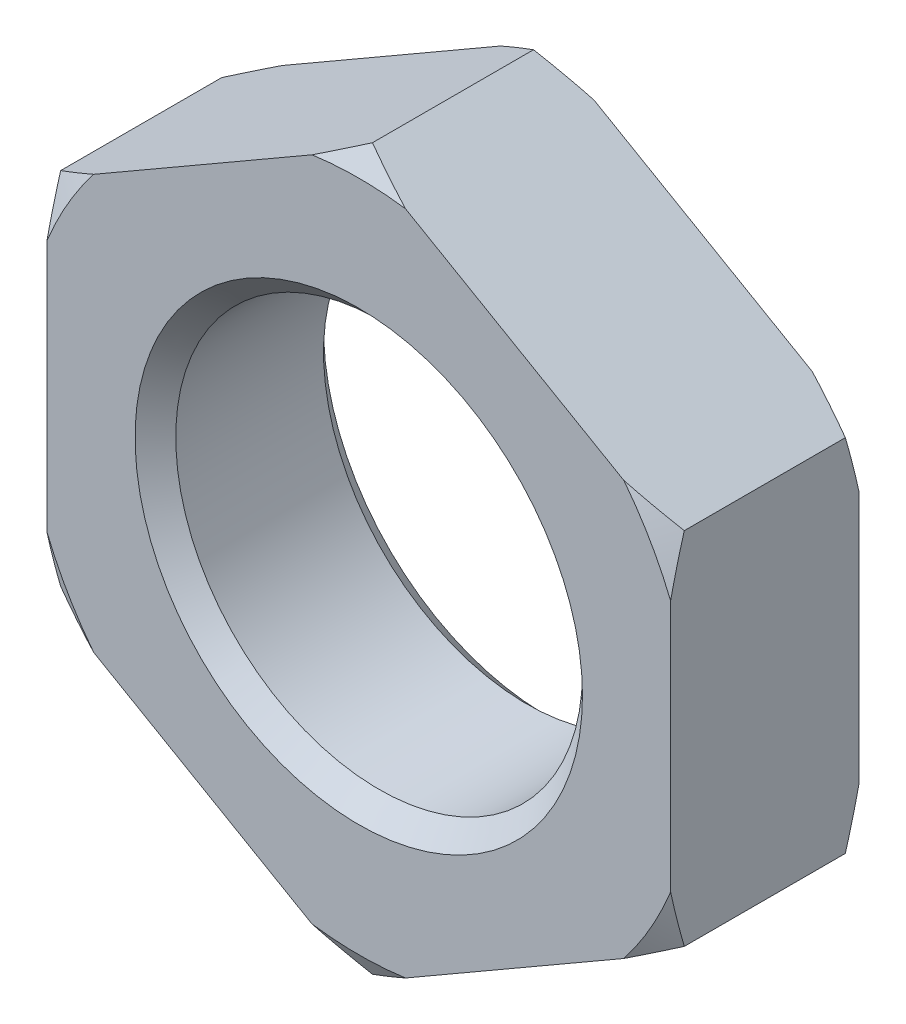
ISO-10303-21;
HEADER;
FILE_DESCRIPTION(('STEP AP214'),'2;1');
FILE_NAME('part.step','',(''),(''),'','','');
FILE_SCHEMA(('AUTOMOTIVE_DESIGN { 1 0 10303 214 1 1 1 1 }'));
ENDSEC;
DATA;
#1=APPLICATION_CONTEXT('core data for automotive mechanical design processes');
#2=APPLICATION_PROTOCOL_DEFINITION('international standard','automotive_design',2000,#1);
#3=PRODUCT_CONTEXT('',#1,'mechanical');
#4=PRODUCT('Part','Part','',(#3));
#5=PRODUCT_RELATED_PRODUCT_CATEGORY('part','',(#4));
#6=PRODUCT_DEFINITION_FORMATION('','',#4);
#7=PRODUCT_DEFINITION_CONTEXT('part definition',#1,'design');
#8=PRODUCT_DEFINITION('design','',#6,#7);
#9=PRODUCT_DEFINITION_SHAPE('','',#8);
#10=(LENGTH_UNIT() NAMED_UNIT(*) SI_UNIT(.MILLI.,.METRE.));
#11=(NAMED_UNIT(*) PLANE_ANGLE_UNIT() SI_UNIT($,.RADIAN.));
#12=(NAMED_UNIT(*) SI_UNIT($,.STERADIAN.) SOLID_ANGLE_UNIT());
#13=UNCERTAINTY_MEASURE_WITH_UNIT(LENGTH_MEASURE(1.E-05),#10,'distance_accuracy_value','');
#14=(GEOMETRIC_REPRESENTATION_CONTEXT(3) GLOBAL_UNCERTAINTY_ASSIGNED_CONTEXT((#13)) GLOBAL_UNIT_ASSIGNED_CONTEXT((#10,
#11,#12)) REPRESENTATION_CONTEXT('',''));
#15=CARTESIAN_POINT('',(0.,0.,0.));
#16=DIRECTION('',(0.,0.,1.));
#17=DIRECTION('',(1.,0.,0.));
#18=AXIS2_PLACEMENT_3D('',#15,#16,#17);
#19=CARTESIAN_POINT('',(0.,0.,-6.95));
#20=DIRECTION('',(0.,0.,1.));
#21=DIRECTION('',(1.,0.,0.));
#22=AXIS2_PLACEMENT_3D('',#19,#20,#21);
#23=PLANE('',#22);
#24=CARTESIAN_POINT('',(0.,0.,-6.95));
#25=DIRECTION('',(0.,0.,1.));
#26=DIRECTION('',(1.,0.,0.));
#27=AXIS2_PLACEMENT_3D('',#24,#25,#26);
#28=CIRCLE('',#27,16.5);
#29=CARTESIAN_POINT('',(16.5,0.,-6.95));
#30=VERTEX_POINT('',#29);
#31=EDGE_CURVE('E428',#30,#30,#28,.T.);
#32=ORIENTED_EDGE('',*,*,#31,.T.);
#33=EDGE_LOOP('',(#32));
#34=FACE_BOUND('',#33,.T.);
#35=DIRECTION('',(0.,1.,0.));
#36=VECTOR('',#35,1.);
#37=CARTESIAN_POINT('',(23.,-13.2790561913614,-6.95));
#38=LINE('',#37,#36);
#39=CARTESIAN_POINT('',(23.,-9.29744265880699,-6.95));
#40=VERTEX_POINT('',#39);
#41=CARTESIAN_POINT('',(23.,9.29744265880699,-6.95));
#42=VERTEX_POINT('',#41);
#43=EDGE_CURVE('E360',#40,#42,#38,.T.);
#44=ORIENTED_EDGE('',*,*,#43,.F.);
#45=CARTESIAN_POINT('',(0.,0.,-6.95));
#46=DIRECTION('',(0.,0.,-1.));
#47=DIRECTION('',(-1.,0.,0.));
#48=AXIS2_PLACEMENT_3D('',#45,#46,#47);
#49=CIRCLE('',#48,24.8081123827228);
#50=CARTESIAN_POINT('',(19.551821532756,-15.2698629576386,-6.95));
#51=VERTEX_POINT('',#50);
#52=EDGE_CURVE('E349',#40,#51,#49,.T.);
#53=ORIENTED_EDGE('',*,*,#52,.T.);
#54=DIRECTION('',(0.866025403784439,0.5,0.));
#55=VECTOR('',#54,1.);
#56=CARTESIAN_POINT('',(0.,-26.5581123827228,-6.95));
#57=LINE('',#56,#55);
#58=CARTESIAN_POINT('',(3.44817846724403,-24.5673056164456,-6.95));
#59=VERTEX_POINT('',#58);
#60=EDGE_CURVE('E371',#59,#51,#57,.T.);
#61=ORIENTED_EDGE('',*,*,#60,.F.);
#62=CARTESIAN_POINT('',(-3.44817846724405,-24.5673056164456,-6.95));
#63=VERTEX_POINT('',#62);
#64=EDGE_CURVE('E344',#59,#63,#49,.T.);
#65=ORIENTED_EDGE('',*,*,#64,.T.);
#66=DIRECTION('',(0.866025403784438,-0.5,0.));
#67=VECTOR('',#66,1.);
#68=CARTESIAN_POINT('',(-23.,-13.2790561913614,-6.95));
#69=LINE('',#68,#67);
#70=CARTESIAN_POINT('',(-19.551821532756,-15.2698629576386,-6.95));
#71=VERTEX_POINT('',#70);
#72=EDGE_CURVE('E377',#71,#63,#69,.T.);
#73=ORIENTED_EDGE('',*,*,#72,.F.);
#74=CARTESIAN_POINT('',(-23.,-9.29744265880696,-6.95));
#75=VERTEX_POINT('',#74);
#76=EDGE_CURVE('E336',#71,#75,#49,.T.);
#77=ORIENTED_EDGE('',*,*,#76,.T.);
#78=DIRECTION('',(0.,-1.,0.));
#79=VECTOR('',#78,1.);
#80=CARTESIAN_POINT('',(-23.,13.2790561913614,-6.95));
#81=LINE('',#80,#79);
#82=CARTESIAN_POINT('',(-23.,9.29744265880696,-6.95));
#83=VERTEX_POINT('',#82);
#84=EDGE_CURVE('E474',#83,#75,#81,.T.);
#85=ORIENTED_EDGE('',*,*,#84,.F.);
#86=CARTESIAN_POINT('',(-19.551821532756,15.2698629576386,-6.95));
#87=VERTEX_POINT('',#86);
#88=EDGE_CURVE('E63',#83,#87,#49,.T.);
#89=ORIENTED_EDGE('',*,*,#88,.T.);
#90=DIRECTION('',(-0.866025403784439,-0.5,0.));
#91=VECTOR('',#90,1.);
#92=CARTESIAN_POINT('',(0.,26.5581123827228,-6.95));
#93=LINE('',#92,#91);
#94=CARTESIAN_POINT('',(-3.44817846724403,24.5673056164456,-6.95));
#95=VERTEX_POINT('',#94);
#96=EDGE_CURVE('E181',#95,#87,#93,.T.);
#97=ORIENTED_EDGE('',*,*,#96,.F.);
#98=CARTESIAN_POINT('',(3.44817846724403,24.5673056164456,-6.95));
#99=VERTEX_POINT('',#98);
#100=EDGE_CURVE('E55',#95,#99,#49,.T.);
#101=ORIENTED_EDGE('',*,*,#100,.T.);
#102=DIRECTION('',(-0.866025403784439,0.5,0.));
#103=VECTOR('',#102,1.);
#104=CARTESIAN_POINT('',(23.,13.2790561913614,-6.95));
#105=LINE('',#104,#103);
#106=CARTESIAN_POINT('',(19.551821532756,15.2698629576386,-6.95));
#107=VERTEX_POINT('',#106);
#108=EDGE_CURVE('E361',#107,#99,#105,.T.);
#109=ORIENTED_EDGE('',*,*,#108,.F.);
#110=EDGE_CURVE('E341',#107,#42,#49,.T.);
#111=ORIENTED_EDGE('',*,*,#110,.T.);
#112=EDGE_LOOP('',(#44,#53,#61,#65,#73,#77,#85,#89,#97,#101,#109,#111));
#113=FACE_BOUND('',#112,.T.);
#114=ADVANCED_FACE('F39',(#34,#113),#23,.F.);
#115=CARTESIAN_POINT('',(0.,0.,6.95));
#116=DIRECTION('',(0.,0.,1.));
#117=DIRECTION('',(1.,0.,0.));
#118=AXIS2_PLACEMENT_3D('',#115,#116,#117);
#119=PLANE('',#118);
#120=CARTESIAN_POINT('',(0.,0.,6.95));
#121=DIRECTION('',(0.,0.,1.));
#122=DIRECTION('',(1.,0.,0.));
#123=AXIS2_PLACEMENT_3D('',#120,#121,#122);
#124=CIRCLE('',#123,16.5);
#125=CARTESIAN_POINT('',(16.5,0.,6.95));
#126=VERTEX_POINT('',#125);
#127=EDGE_CURVE('E11',#126,#126,#124,.F.);
#128=ORIENTED_EDGE('',*,*,#127,.T.);
#129=EDGE_LOOP('',(#128));
#130=FACE_BOUND('',#129,.T.);
#131=CARTESIAN_POINT('',(0.,0.,6.95));
#132=DIRECTION('',(0.,0.,-1.));
#133=DIRECTION('',(-1.,0.,0.));
#134=AXIS2_PLACEMENT_3D('',#131,#132,#133);
#135=CIRCLE('',#134,24.8081123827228);
#136=CARTESIAN_POINT('',(23.,-9.29744265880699,6.95));
#137=VERTEX_POINT('',#136);
#138=CARTESIAN_POINT('',(19.551821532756,-15.2698629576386,6.95));
#139=VERTEX_POINT('',#138);
#140=EDGE_CURVE('E314',#137,#139,#135,.T.);
#141=ORIENTED_EDGE('',*,*,#140,.F.);
#142=DIRECTION('',(0.,1.,0.));
#143=VECTOR('',#142,1.);
#144=CARTESIAN_POINT('',(23.,-13.2790561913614,6.95));
#145=LINE('',#144,#143);
#146=CARTESIAN_POINT('',(23.,9.29744265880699,6.95));
#147=VERTEX_POINT('',#146);
#148=EDGE_CURVE('E384',#137,#147,#145,.T.);
#149=ORIENTED_EDGE('',*,*,#148,.T.);
#150=CARTESIAN_POINT('',(19.551821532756,15.2698629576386,6.95));
#151=VERTEX_POINT('',#150);
#152=EDGE_CURVE('E306',#151,#147,#135,.T.);
#153=ORIENTED_EDGE('',*,*,#152,.F.);
#154=DIRECTION('',(-0.866025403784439,0.5,0.));
#155=VECTOR('',#154,1.);
#156=CARTESIAN_POINT('',(23.,13.2790561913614,6.95));
#157=LINE('',#156,#155);
#158=CARTESIAN_POINT('',(3.44817846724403,24.5673056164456,6.95));
#159=VERTEX_POINT('',#158);
#160=EDGE_CURVE('E370',#151,#159,#157,.T.);
#161=ORIENTED_EDGE('',*,*,#160,.T.);
#162=CARTESIAN_POINT('',(-3.44817846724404,24.5673056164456,6.95));
#163=VERTEX_POINT('',#162);
#164=EDGE_CURVE('E296',#163,#159,#135,.T.);
#165=ORIENTED_EDGE('',*,*,#164,.F.);
#166=DIRECTION('',(-0.866025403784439,-0.5,0.));
#167=VECTOR('',#166,1.);
#168=CARTESIAN_POINT('',(0.,26.5581123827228,6.95));
#169=LINE('',#168,#167);
#170=CARTESIAN_POINT('',(-19.551821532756,15.2698629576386,6.95));
#171=VERTEX_POINT('',#170);
#172=EDGE_CURVE('E376',#163,#171,#169,.T.);
#173=ORIENTED_EDGE('',*,*,#172,.T.);
#174=CARTESIAN_POINT('',(-23.,9.29744265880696,6.95));
#175=VERTEX_POINT('',#174);
#176=EDGE_CURVE('E294',#175,#171,#135,.T.);
#177=ORIENTED_EDGE('',*,*,#176,.F.);
#178=DIRECTION('',(0.,-1.,0.));
#179=VECTOR('',#178,1.);
#180=CARTESIAN_POINT('',(-23.,13.2790561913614,6.95));
#181=LINE('',#180,#179);
#182=CARTESIAN_POINT('',(-23.,-9.29744265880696,6.95));
#183=VERTEX_POINT('',#182);
#184=EDGE_CURVE('E494',#175,#183,#181,.T.);
#185=ORIENTED_EDGE('',*,*,#184,.T.);
#186=CARTESIAN_POINT('',(-19.551821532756,-15.2698629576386,6.95));
#187=VERTEX_POINT('',#186);
#188=EDGE_CURVE('E297',#187,#183,#135,.T.);
#189=ORIENTED_EDGE('',*,*,#188,.F.);
#190=DIRECTION('',(0.866025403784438,-0.5,0.));
#191=VECTOR('',#190,1.);
#192=CARTESIAN_POINT('',(-23.,-13.2790561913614,6.95));
#193=LINE('',#192,#191);
#194=CARTESIAN_POINT('',(-3.44817846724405,-24.5673056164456,6.95));
#195=VERTEX_POINT('',#194);
#196=EDGE_CURVE('E465',#187,#195,#193,.T.);
#197=ORIENTED_EDGE('',*,*,#196,.T.);
#198=CARTESIAN_POINT('',(3.44817846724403,-24.5673056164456,6.95));
#199=VERTEX_POINT('',#198);
#200=EDGE_CURVE('E308',#199,#195,#135,.T.);
#201=ORIENTED_EDGE('',*,*,#200,.F.);
#202=DIRECTION('',(0.866025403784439,0.5,0.));
#203=VECTOR('',#202,1.);
#204=CARTESIAN_POINT('',(0.,-26.5581123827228,6.95));
#205=LINE('',#204,#203);
#206=EDGE_CURVE('E463',#199,#139,#205,.T.);
#207=ORIENTED_EDGE('',*,*,#206,.T.);
#208=EDGE_LOOP('',(#141,#149,#153,#161,#165,#173,#177,#185,#189,#197,#201,#207));
#209=FACE_BOUND('',#208,.T.);
#210=ADVANCED_FACE('F419',(#130,#209),#119,.T.);
#211=CARTESIAN_POINT('',(23.,13.2790561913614,6.95));
#212=DIRECTION('',(-0.5,-0.866025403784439,0.));
#213=DIRECTION('',(0.866025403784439,-0.5,0.));
#214=AXIS2_PLACEMENT_3D('',#211,#212,#213);
#215=PLANE('',#214);
#216=DIRECTION('',(0.,0.,-1.));
#217=VECTOR('',#216,1.);
#218=CARTESIAN_POINT('',(23.,13.2790561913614,6.95));
#219=LINE('',#218,#217);
#220=CARTESIAN_POINT('',(23.,13.2790561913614,5.93963702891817));
#221=VERTEX_POINT('',#220);
#222=CARTESIAN_POINT('',(23.,13.2790561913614,-5.93963702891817));
#223=VERTEX_POINT('',#222);
#224=EDGE_CURVE('E381',#221,#223,#219,.T.);
#225=ORIENTED_EDGE('',*,*,#224,.T.);
#226=CARTESIAN_POINT('',(38.9465945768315,4.07228551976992,1.33544059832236));
#227=CARTESIAN_POINT('',(38.5853541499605,4.28084777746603,1.14053464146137));
#228=CARTESIAN_POINT('',(38.2236753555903,4.48966312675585,0.946712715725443));
#229=CARTESIAN_POINT('',(37.4993642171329,4.90784435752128,0.561449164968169));
#230=CARTESIAN_POINT('',(37.1367318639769,5.11721024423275,0.370007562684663));
#231=CARTESIAN_POINT('',(36.047214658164,5.74624329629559,-0.200467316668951));
#232=CARTESIAN_POINT('',(35.3187941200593,6.16679709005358,-0.575604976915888));
#233=CARTESIAN_POINT('',(33.8548580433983,7.01200097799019,-1.31456588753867));
#234=CARTESIAN_POINT('',(33.1193272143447,7.43665990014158,-1.67834883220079));
#235=CARTESIAN_POINT('',(31.6427485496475,8.28916298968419,-2.39063791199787));
#236=CARTESIAN_POINT('',(30.9017008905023,8.71700705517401,-2.73914453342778));
#237=CARTESIAN_POINT('',(29.3943623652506,9.58726935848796,-3.42611670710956));
#238=CARTESIAN_POINT('',(28.6279074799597,10.0297822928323,-3.7641044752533));
#239=CARTESIAN_POINT('',(27.0872530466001,10.9192795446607,-4.41595052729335));
#240=CARTESIAN_POINT('',(26.3130531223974,11.3662640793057,-4.72980763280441));
#241=CARTESIAN_POINT('',(24.7567687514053,12.2647852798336,-5.32740068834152));
#242=CARTESIAN_POINT('',(23.9746927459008,12.7163170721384,-5.61116576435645));
#243=CARTESIAN_POINT('',(22.4012522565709,13.6247433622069,-6.14202830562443));
#244=CARTESIAN_POINT('',(21.6098889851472,14.0816371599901,-6.38913050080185));
#245=CARTESIAN_POINT('',(20.2655342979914,14.8578007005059,-6.76874725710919));
#246=CARTESIAN_POINT('',(19.7150259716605,15.1756368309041,-6.91298699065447));
#247=CARTESIAN_POINT('',(18.6096932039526,15.8138010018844,-7.1775537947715));
#248=CARTESIAN_POINT('',(18.0548688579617,16.1341289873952,-7.29788139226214));
#249=CARTESIAN_POINT('',(16.9415016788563,16.7769318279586,-7.51189837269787));
#250=CARTESIAN_POINT('',(16.3829598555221,17.0994061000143,-7.60559470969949));
#251=CARTESIAN_POINT('',(15.2627766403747,17.7461441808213,-7.76397752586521));
#252=CARTESIAN_POINT('',(14.7011352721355,18.0704079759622,-7.82866422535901));
#253=CARTESIAN_POINT('',(13.5823244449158,18.7163537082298,-7.9266072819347));
#254=CARTESIAN_POINT('',(13.0251785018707,19.0380220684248,-7.96021888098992));
#255=CARTESIAN_POINT('',(11.9101327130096,19.6817940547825,-7.99628844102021));
#256=CARTESIAN_POINT('',(11.3522328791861,20.0038976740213,-7.99874689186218));
#257=CARTESIAN_POINT('',(10.2369580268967,20.6478019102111,-7.97243235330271));
#258=CARTESIAN_POINT('',(9.67958303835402,20.9696025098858,-7.94365767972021));
#259=CARTESIAN_POINT('',(8.56663540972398,21.6121631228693,-7.85574898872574));
#260=CARTESIAN_POINT('',(8.01106285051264,21.9329230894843,-7.79661362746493));
#261=CARTESIAN_POINT('',(6.6976631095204,22.6912147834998,-7.62242315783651));
#262=CARTESIAN_POINT('',(5.941079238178,23.1280286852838,-7.49477223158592));
#263=CARTESIAN_POINT('',(4.43515818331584,23.9974726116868,-7.19152518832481));
#264=CARTESIAN_POINT('',(3.68582222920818,24.4301019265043,-7.01592108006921));
#265=CARTESIAN_POINT('',(2.19458732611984,25.2910667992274,-6.62342388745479));
#266=CARTESIAN_POINT('',(1.4526967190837,25.7193975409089,-6.40648897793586));
#267=CARTESIAN_POINT('',(-0.0227731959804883,26.5712604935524,-5.93814052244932));
#268=CARTESIAN_POINT('',(-0.756352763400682,26.9947928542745,-5.68672805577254));
#269=CARTESIAN_POINT('',(-2.22412531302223,27.8422117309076,-5.1523246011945));
#270=CARTESIAN_POINT('',(-2.95822699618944,28.2660455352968,-4.86900159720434));
#271=CARTESIAN_POINT('',(-4.41914401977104,29.1095063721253,-4.27843836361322));
#272=CARTESIAN_POINT('',(-5.14595929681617,29.5291333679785,-3.97119792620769));
#273=CARTESIAN_POINT('',(-6.59273887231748,30.3644319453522,-3.33728072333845));
#274=CARTESIAN_POINT('',(-7.31270656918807,30.7801054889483,-3.01061425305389));
#275=CARTESIAN_POINT('',(-8.74697353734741,31.6081799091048,-2.34118947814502));
#276=CARTESIAN_POINT('',(-9.46127293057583,32.0205808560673,-1.99843152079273));
#277=CARTESIAN_POINT('',(-10.6608099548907,32.7131338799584,-1.40962846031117));
#278=CARTESIAN_POINT('',(-11.1473530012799,32.9940396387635,-1.16711422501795));
#279=CARTESIAN_POINT('',(-12.1183342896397,33.5546359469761,-0.676580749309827));
#280=CARTESIAN_POINT('',(-12.6027725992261,33.8343265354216,-0.428561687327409));
#281=CARTESIAN_POINT('',(-13.5647219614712,34.3897082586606,0.0697306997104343));
#282=CARTESIAN_POINT('',(-14.0422526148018,34.6654107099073,0.319953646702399));
#283=CARTESIAN_POINT('',(-14.995639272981,35.2158487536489,0.824644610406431));
#284=CARTESIAN_POINT('',(-15.4714952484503,35.4905843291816,1.07911270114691));
#285=CARTESIAN_POINT('',(-15.9465945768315,35.7648830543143,1.33544059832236));
#286=B_SPLINE_CURVE_WITH_KNOTS('',3,(#226,#227,#228,#229,#230,#231,#232,#233,#234,#235,#236,
#237,#238,#239,#240,#241,#242,#243,#244,#245,#246,#247,#248,#249,#250,#251,#252,#253,#254,#255,
#256,#257,#258,#259,#260,#261,#262,#263,#264,#265,#266,#267,#268,#269,#270,#271,#272,#273,#274,
#275,#276,#277,#278,#279,#280,#281,#282,#283,#284,#285),.UNSPECIFIED.,.F.,.F.,(4,2,2,2,2,2,2,2,
2,2,2,2,2,2,2,2,2,2,2,2,2,2,2,2,2,2,2,2,2,4),(0.,1.38123955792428,2.76249229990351,
5.52532086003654,8.29704245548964,11.0686757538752,13.9104983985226,16.7524597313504,
19.5916447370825,22.4304631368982,24.3855678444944,26.3406294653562,28.2951801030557,
30.2497158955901,32.181621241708,34.1134962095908,36.0454753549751,37.9775400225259,
40.6246502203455,43.2722018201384,45.9224470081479,48.572609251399,51.2534655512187,
53.9343451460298,56.613816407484,59.2932298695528,61.1289595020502,62.964629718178,
64.7811822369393,66.5977664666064),.UNSPECIFIED.);
#287=EDGE_CURVE('E318',#223,#107,#286,.T.);
#288=ORIENTED_EDGE('',*,*,#287,.T.);
#289=ORIENTED_EDGE('',*,*,#108,.T.);
#290=CARTESIAN_POINT('',(0.,26.5581123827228,-5.93963702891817));
#291=VERTEX_POINT('',#290);
#292=EDGE_CURVE('E309',#99,#291,#286,.T.);
#293=ORIENTED_EDGE('',*,*,#292,.T.);
#294=DIRECTION('',(0.,0.,-1.));
#295=VECTOR('',#294,1.);
#296=CARTESIAN_POINT('',(0.,26.5581123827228,6.95));
#297=LINE('',#296,#295);
#298=CARTESIAN_POINT('',(0.,26.5581123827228,5.93963702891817));
#299=VERTEX_POINT('',#298);
#300=EDGE_CURVE('E190',#299,#291,#297,.T.);
#301=ORIENTED_EDGE('',*,*,#300,.F.);
#302=CARTESIAN_POINT('',(-15.9465945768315,35.7648830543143,-1.33544059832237));
#303=CARTESIAN_POINT('',(-15.5853541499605,35.5563207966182,-1.14053464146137));
#304=CARTESIAN_POINT('',(-15.2236753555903,35.3475054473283,-0.946712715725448));
#305=CARTESIAN_POINT('',(-14.4993642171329,34.9293242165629,-0.561449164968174));
#306=CARTESIAN_POINT('',(-14.1367318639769,34.7199583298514,-0.370007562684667));
#307=CARTESIAN_POINT('',(-13.047214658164,34.0909252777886,0.200467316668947));
#308=CARTESIAN_POINT('',(-12.3187941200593,33.6703714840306,0.575604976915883));
#309=CARTESIAN_POINT('',(-10.8548580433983,32.825167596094,1.31456588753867));
#310=CARTESIAN_POINT('',(-10.1193272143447,32.4005086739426,1.67834883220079));
#311=CARTESIAN_POINT('',(-8.64274854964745,31.5480055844,2.39063791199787));
#312=CARTESIAN_POINT('',(-7.90170089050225,31.1201615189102,2.73914453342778));
#313=CARTESIAN_POINT('',(-6.39436236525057,30.2498992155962,3.42611670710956));
#314=CARTESIAN_POINT('',(-5.62790747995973,29.8073862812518,3.7641044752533));
#315=CARTESIAN_POINT('',(-4.08725304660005,28.9178890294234,4.41595052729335));
#316=CARTESIAN_POINT('',(-3.3130531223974,28.4709044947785,4.72980763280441));
#317=CARTESIAN_POINT('',(-1.75676875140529,27.5723832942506,5.32740068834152));
#318=CARTESIAN_POINT('',(-0.97469274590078,27.1208515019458,5.61116576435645));
#319=CARTESIAN_POINT('',(0.598747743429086,26.2124252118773,6.14202830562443));
#320=CARTESIAN_POINT('',(1.39011101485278,25.7555314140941,6.38913050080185));
#321=CARTESIAN_POINT('',(2.73446570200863,24.9793678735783,6.76874725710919));
#322=CARTESIAN_POINT('',(3.28497402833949,24.6615317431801,6.91298699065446));
#323=CARTESIAN_POINT('',(4.39030679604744,24.0233675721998,7.1775537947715));
#324=CARTESIAN_POINT('',(4.94513114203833,23.703039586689,7.29788139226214));
#325=CARTESIAN_POINT('',(6.05849832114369,23.0602367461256,7.51189837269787));
#326=CARTESIAN_POINT('',(6.61704014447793,22.7377624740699,7.60559470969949));
#327=CARTESIAN_POINT('',(7.73722335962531,22.0910243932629,7.7639775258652));
#328=CARTESIAN_POINT('',(8.29886472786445,21.766760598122,7.82866422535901));
#329=CARTESIAN_POINT('',(9.41767555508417,21.1208148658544,7.9266072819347));
#330=CARTESIAN_POINT('',(9.97482149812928,20.7991465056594,7.96021888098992));
#331=CARTESIAN_POINT('',(11.0898672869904,20.1553745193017,7.99628844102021));
#332=CARTESIAN_POINT('',(11.6477671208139,19.8332709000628,7.99874689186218));
#333=CARTESIAN_POINT('',(12.7630419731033,19.1893666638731,7.97243235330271));
#334=CARTESIAN_POINT('',(13.320416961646,18.8675660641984,7.94365767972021));
#335=CARTESIAN_POINT('',(14.433364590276,18.2250054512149,7.85574898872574));
#336=CARTESIAN_POINT('',(14.9889371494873,17.9042454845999,7.79661362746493));
#337=CARTESIAN_POINT('',(16.3023368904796,17.1459537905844,7.62242315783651));
#338=CARTESIAN_POINT('',(17.058920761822,16.7091398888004,7.49477223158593));
#339=CARTESIAN_POINT('',(18.5648418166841,15.8396959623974,7.19152518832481));
#340=CARTESIAN_POINT('',(19.3141777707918,15.4070666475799,7.01592108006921));
#341=CARTESIAN_POINT('',(20.8054126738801,14.5461017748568,6.62342388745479));
#342=CARTESIAN_POINT('',(21.5473032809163,14.1177710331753,6.40648897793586));
#343=CARTESIAN_POINT('',(23.0227731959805,13.2659080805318,5.93814052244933));
#344=CARTESIAN_POINT('',(23.7563527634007,12.8423757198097,5.68672805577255));
#345=CARTESIAN_POINT('',(25.2241253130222,11.9949568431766,5.1523246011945));
#346=CARTESIAN_POINT('',(25.9582269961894,11.5711230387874,4.86900159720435));
#347=CARTESIAN_POINT('',(27.419144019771,10.7276622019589,4.27843836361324));
#348=CARTESIAN_POINT('',(28.1459592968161,10.3080352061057,3.9711979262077));
#349=CARTESIAN_POINT('',(29.5927388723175,9.472736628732,3.33728072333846));
#350=CARTESIAN_POINT('',(30.312706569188,9.05706308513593,3.01061425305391));
#351=CARTESIAN_POINT('',(31.7469735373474,8.22898866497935,2.34118947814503));
#352=CARTESIAN_POINT('',(32.4612729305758,7.81658771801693,1.99843152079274));
#353=CARTESIAN_POINT('',(33.6608099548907,7.12403469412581,1.40962846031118));
#354=CARTESIAN_POINT('',(34.1473530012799,6.84312893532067,1.16711422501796));
#355=CARTESIAN_POINT('',(35.1183342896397,6.28253262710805,0.676580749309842));
#356=CARTESIAN_POINT('',(35.602772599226,6.00284203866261,0.428561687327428));
#357=CARTESIAN_POINT('',(36.5647219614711,5.44746031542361,-0.0697306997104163));
#358=CARTESIAN_POINT('',(37.0422526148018,5.17175786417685,-0.319953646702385));
#359=CARTESIAN_POINT('',(37.995639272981,4.6213198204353,-0.824644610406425));
#360=CARTESIAN_POINT('',(38.4714952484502,4.34658424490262,-1.07911270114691));
#361=CARTESIAN_POINT('',(38.9465945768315,4.07228551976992,-1.33544059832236));
#362=B_SPLINE_CURVE_WITH_KNOTS('',3,(#302,#303,#304,#305,#306,#307,#308,#309,#310,#311,#312,
#313,#314,#315,#316,#317,#318,#319,#320,#321,#322,#323,#324,#325,#326,#327,#328,#329,#330,#331,
#332,#333,#334,#335,#336,#337,#338,#339,#340,#341,#342,#343,#344,#345,#346,#347,#348,#349,#350,
#351,#352,#353,#354,#355,#356,#357,#358,#359,#360,#361),.UNSPECIFIED.,.F.,.F.,(4,2,2,2,2,2,2,2,
2,2,2,2,2,2,2,2,2,2,2,2,2,2,2,2,2,2,2,2,2,4),(0.,1.38123955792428,2.76249229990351,
5.52532086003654,8.29704245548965,11.0686757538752,13.9104983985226,16.7524597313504,
19.5916447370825,22.4304631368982,24.3855678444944,26.3406294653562,28.2951801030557,
30.2497158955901,32.181621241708,34.1134962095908,36.0454753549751,37.9775400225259,
40.6246502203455,43.2722018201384,45.9224470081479,48.572609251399,51.2534655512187,
53.9343451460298,56.613816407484,59.2932298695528,61.1289595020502,62.964629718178,
64.7811822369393,66.5977664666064),.UNSPECIFIED.);
#363=EDGE_CURVE('E471',#299,#159,#362,.T.);
#364=ORIENTED_EDGE('',*,*,#363,.T.);
#365=ORIENTED_EDGE('',*,*,#160,.F.);
#366=EDGE_CURVE('E247',#151,#221,#362,.T.);
#367=ORIENTED_EDGE('',*,*,#366,.T.);
#368=EDGE_LOOP('',(#225,#288,#289,#293,#301,#364,#365,#367));
#369=FACE_BOUND('',#368,.T.);
#370=ADVANCED_FACE('F424',(#369),#215,.F.);
#371=CARTESIAN_POINT('',(0.,26.5581123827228,6.95));
#372=DIRECTION('',(0.5,-0.866025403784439,0.));
#373=DIRECTION('',(0.866025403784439,0.5,0.));
#374=AXIS2_PLACEMENT_3D('',#371,#372,#373);
#375=PLANE('',#374);
#376=ORIENTED_EDGE('',*,*,#300,.T.);
#377=CARTESIAN_POINT('',(15.9465945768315,35.7648830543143,1.33544059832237));
#378=CARTESIAN_POINT('',(15.5853541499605,35.5563207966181,1.14053464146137));
#379=CARTESIAN_POINT('',(15.2236753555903,35.3475054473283,0.946712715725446));
#380=CARTESIAN_POINT('',(14.4993642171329,34.9293242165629,0.561449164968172));
#381=CARTESIAN_POINT('',(14.1367318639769,34.7199583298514,0.370007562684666));
#382=CARTESIAN_POINT('',(13.047214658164,34.0909252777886,-0.200467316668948));
#383=CARTESIAN_POINT('',(12.3187941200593,33.6703714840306,-0.575604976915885));
#384=CARTESIAN_POINT('',(10.8548580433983,32.825167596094,-1.31456588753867));
#385=CARTESIAN_POINT('',(10.1193272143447,32.4005086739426,-1.67834883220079));
#386=CARTESIAN_POINT('',(8.64274854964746,31.5480055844,-2.39063791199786));
#387=CARTESIAN_POINT('',(7.90170089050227,31.1201615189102,-2.73914453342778));
#388=CARTESIAN_POINT('',(6.39436236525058,30.2498992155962,-3.42611670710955));
#389=CARTESIAN_POINT('',(5.62790747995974,29.8073862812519,-3.76410447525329));
#390=CARTESIAN_POINT('',(4.08725304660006,28.9178890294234,-4.41595052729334));
#391=CARTESIAN_POINT('',(3.31305312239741,28.4709044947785,-4.72980763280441));
#392=CARTESIAN_POINT('',(1.7567687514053,27.5723832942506,-5.32740068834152));
#393=CARTESIAN_POINT('',(0.974692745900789,27.1208515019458,-5.61116576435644));
#394=CARTESIAN_POINT('',(-0.598747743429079,26.2124252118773,-6.14202830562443));
#395=CARTESIAN_POINT('',(-1.39011101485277,25.7555314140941,-6.38913050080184));
#396=CARTESIAN_POINT('',(-2.73446570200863,24.9793678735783,-6.76874725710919));
#397=CARTESIAN_POINT('',(-3.28497402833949,24.6615317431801,-6.91298699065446));
#398=CARTESIAN_POINT('',(-4.39030679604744,24.0233675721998,-7.1775537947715));
#399=CARTESIAN_POINT('',(-4.94513114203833,23.703039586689,-7.29788139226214));
#400=CARTESIAN_POINT('',(-6.05849832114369,23.0602367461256,-7.51189837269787));
#401=CARTESIAN_POINT('',(-6.61704014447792,22.7377624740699,-7.60559470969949));
#402=CARTESIAN_POINT('',(-7.7372233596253,22.0910243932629,-7.7639775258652));
#403=CARTESIAN_POINT('',(-8.29886472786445,21.766760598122,-7.82866422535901));
#404=CARTESIAN_POINT('',(-9.41767555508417,21.1208148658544,-7.9266072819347));
#405=CARTESIAN_POINT('',(-9.97482149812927,20.7991465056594,-7.96021888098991));
#406=CARTESIAN_POINT('',(-11.0898672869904,20.1553745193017,-7.9962884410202));
#407=CARTESIAN_POINT('',(-11.6477671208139,19.8332709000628,-7.99874689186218));
#408=CARTESIAN_POINT('',(-12.7630419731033,19.1893666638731,-7.97243235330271));
#409=CARTESIAN_POINT('',(-13.320416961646,18.8675660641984,-7.94365767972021));
#410=CARTESIAN_POINT('',(-14.433364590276,18.2250054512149,-7.85574898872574));
#411=CARTESIAN_POINT('',(-14.9889371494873,17.9042454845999,-7.79661362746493));
#412=CARTESIAN_POINT('',(-16.3023368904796,17.1459537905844,-7.6224231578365));
#413=CARTESIAN_POINT('',(-17.058920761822,16.7091398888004,-7.49477223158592));
#414=CARTESIAN_POINT('',(-18.5648418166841,15.8396959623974,-7.1915251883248));
#415=CARTESIAN_POINT('',(-19.3141777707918,15.4070666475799,-7.01592108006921));
#416=CARTESIAN_POINT('',(-20.8054126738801,14.5461017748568,-6.62342388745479));
#417=CARTESIAN_POINT('',(-21.5473032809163,14.1177710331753,-6.40648897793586));
#418=CARTESIAN_POINT('',(-23.0227731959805,13.2659080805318,-5.93814052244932));
#419=CARTESIAN_POINT('',(-23.7563527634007,12.8423757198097,-5.68672805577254));
#420=CARTESIAN_POINT('',(-25.2241253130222,11.9949568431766,-5.1523246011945));
#421=CARTESIAN_POINT('',(-25.9582269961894,11.5711230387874,-4.86900159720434));
#422=CARTESIAN_POINT('',(-27.419144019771,10.7276622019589,-4.27843836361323));
#423=CARTESIAN_POINT('',(-28.1459592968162,10.3080352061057,-3.9711979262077));
#424=CARTESIAN_POINT('',(-29.5927388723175,9.47273662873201,-3.33728072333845));
#425=CARTESIAN_POINT('',(-30.312706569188,9.05706308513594,-3.0106142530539));
#426=CARTESIAN_POINT('',(-31.7469735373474,8.22898866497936,-2.34118947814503));
#427=CARTESIAN_POINT('',(-32.4612729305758,7.81658771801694,-1.99843152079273));
#428=CARTESIAN_POINT('',(-33.6608099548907,7.12403469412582,-1.40962846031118));
#429=CARTESIAN_POINT('',(-34.1473530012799,6.84312893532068,-1.16711422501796));
#430=CARTESIAN_POINT('',(-35.1183342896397,6.28253262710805,-0.676580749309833));
#431=CARTESIAN_POINT('',(-35.602772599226,6.00284203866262,-0.428561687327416));
#432=CARTESIAN_POINT('',(-36.5647219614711,5.44746031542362,0.0697306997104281));
#433=CARTESIAN_POINT('',(-37.0422526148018,5.17175786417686,0.319953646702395));
#434=CARTESIAN_POINT('',(-37.995639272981,4.62131982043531,0.824644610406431));
#435=CARTESIAN_POINT('',(-38.4714952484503,4.34658424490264,1.07911270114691));
#436=CARTESIAN_POINT('',(-38.9465945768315,4.07228551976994,1.33544059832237));
#437=B_SPLINE_CURVE_WITH_KNOTS('',3,(#377,#378,#379,#380,#381,#382,#383,#384,#385,#386,#387,
#388,#389,#390,#391,#392,#393,#394,#395,#396,#397,#398,#399,#400,#401,#402,#403,#404,#405,#406,
#407,#408,#409,#410,#411,#412,#413,#414,#415,#416,#417,#418,#419,#420,#421,#422,#423,#424,#425,
#426,#427,#428,#429,#430,#431,#432,#433,#434,#435,#436),.UNSPECIFIED.,.F.,.F.,(4,2,2,2,2,2,2,2,
2,2,2,2,2,2,2,2,2,2,2,2,2,2,2,2,2,2,2,2,2,4),(0.,1.38123955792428,2.76249229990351,
5.52532086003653,8.29704245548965,11.0686757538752,13.9104983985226,16.7524597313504,
19.5916447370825,22.4304631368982,24.3855678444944,26.3406294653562,28.2951801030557,
30.2497158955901,32.181621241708,34.1134962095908,36.0454753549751,37.9775400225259,
40.6246502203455,43.2722018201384,45.9224470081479,48.572609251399,51.2534655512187,
53.9343451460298,56.613816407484,59.2932298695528,61.1289595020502,62.964629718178,
64.7811822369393,66.5977664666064),.UNSPECIFIED.);
#438=EDGE_CURVE('E183',#291,#95,#437,.T.);
#439=ORIENTED_EDGE('',*,*,#438,.T.);
#440=ORIENTED_EDGE('',*,*,#96,.T.);
#441=CARTESIAN_POINT('',(-23.,13.2790561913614,-5.93963702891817));
#442=VERTEX_POINT('',#441);
#443=EDGE_CURVE('E165',#87,#442,#437,.T.);
#444=ORIENTED_EDGE('',*,*,#443,.T.);
#445=DIRECTION('',(0.,0.,-1.));
#446=VECTOR('',#445,1.);
#447=CARTESIAN_POINT('',(-23.,13.2790561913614,6.95));
#448=LINE('',#447,#446);
#449=CARTESIAN_POINT('',(-23.,13.2790561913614,5.93963702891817));
#450=VERTEX_POINT('',#449);
#451=EDGE_CURVE('E179',#450,#442,#448,.T.);
#452=ORIENTED_EDGE('',*,*,#451,.F.);
#453=CARTESIAN_POINT('',(-38.9465945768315,4.07228551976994,-1.33544059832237));
#454=CARTESIAN_POINT('',(-38.5853541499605,4.28084777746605,-1.14053464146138));
#455=CARTESIAN_POINT('',(-38.2236753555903,4.48966312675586,-0.946712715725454));
#456=CARTESIAN_POINT('',(-37.4993642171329,4.90784435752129,-0.561449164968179));
#457=CARTESIAN_POINT('',(-37.136731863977,5.11721024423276,-0.370007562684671));
#458=CARTESIAN_POINT('',(-36.047214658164,5.7462432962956,0.200467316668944));
#459=CARTESIAN_POINT('',(-35.3187941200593,6.16679709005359,0.57560497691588));
#460=CARTESIAN_POINT('',(-33.8548580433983,7.01200097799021,1.31456588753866));
#461=CARTESIAN_POINT('',(-33.1193272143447,7.43665990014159,1.67834883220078));
#462=CARTESIAN_POINT('',(-31.6427485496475,8.2891629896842,2.39063791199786));
#463=CARTESIAN_POINT('',(-30.9017008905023,8.71700705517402,2.73914453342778));
#464=CARTESIAN_POINT('',(-29.3943623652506,9.58726935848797,3.42611670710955));
#465=CARTESIAN_POINT('',(-28.6279074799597,10.0297822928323,3.76410447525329));
#466=CARTESIAN_POINT('',(-27.0872530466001,10.9192795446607,4.41595052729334));
#467=CARTESIAN_POINT('',(-26.3130531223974,11.3662640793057,4.72980763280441));
#468=CARTESIAN_POINT('',(-24.7567687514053,12.2647852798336,5.32740068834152));
#469=CARTESIAN_POINT('',(-23.9746927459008,12.7163170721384,5.61116576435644));
#470=CARTESIAN_POINT('',(-22.4012522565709,13.6247433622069,6.14202830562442));
#471=CARTESIAN_POINT('',(-21.6098889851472,14.0816371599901,6.38913050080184));
#472=CARTESIAN_POINT('',(-20.2655342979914,14.8578007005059,6.76874725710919));
#473=CARTESIAN_POINT('',(-19.7150259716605,15.1756368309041,6.91298699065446));
#474=CARTESIAN_POINT('',(-18.6096932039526,15.8138010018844,7.1775537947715));
#475=CARTESIAN_POINT('',(-18.0548688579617,16.1341289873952,7.29788139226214));
#476=CARTESIAN_POINT('',(-16.9415016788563,16.7769318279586,7.51189837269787));
#477=CARTESIAN_POINT('',(-16.3829598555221,17.0994061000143,7.60559470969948));
#478=CARTESIAN_POINT('',(-15.2627766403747,17.7461441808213,7.7639775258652));
#479=CARTESIAN_POINT('',(-14.7011352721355,18.0704079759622,7.82866422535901));
#480=CARTESIAN_POINT('',(-13.5823244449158,18.7163537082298,7.9266072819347));
#481=CARTESIAN_POINT('',(-13.0251785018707,19.0380220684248,7.96021888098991));
#482=CARTESIAN_POINT('',(-11.9101327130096,19.6817940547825,7.9962884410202));
#483=CARTESIAN_POINT('',(-11.3522328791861,20.0038976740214,7.99874689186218));
#484=CARTESIAN_POINT('',(-10.2369580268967,20.6478019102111,7.97243235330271));
#485=CARTESIAN_POINT('',(-9.67958303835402,20.9696025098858,7.94365767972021));
#486=CARTESIAN_POINT('',(-8.56663540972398,21.6121631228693,7.85574898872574));
#487=CARTESIAN_POINT('',(-8.01106285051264,21.9329230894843,7.79661362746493));
#488=CARTESIAN_POINT('',(-6.69766310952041,22.6912147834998,7.6224231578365));
#489=CARTESIAN_POINT('',(-5.94107923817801,23.1280286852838,7.49477223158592));
#490=CARTESIAN_POINT('',(-4.43515818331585,23.9974726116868,7.19152518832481));
#491=CARTESIAN_POINT('',(-3.68582222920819,24.4301019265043,7.01592108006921));
#492=CARTESIAN_POINT('',(-2.19458732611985,25.2910667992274,6.62342388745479));
#493=CARTESIAN_POINT('',(-1.45269671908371,25.7193975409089,6.40648897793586));
#494=CARTESIAN_POINT('',(0.0227731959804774,26.5712604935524,5.93814052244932));
#495=CARTESIAN_POINT('',(0.756352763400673,26.9947928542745,5.68672805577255));
#496=CARTESIAN_POINT('',(2.22412531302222,27.8422117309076,5.1523246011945));
#497=CARTESIAN_POINT('',(2.95822699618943,28.2660455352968,4.86900159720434));
#498=CARTESIAN_POINT('',(4.41914401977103,29.1095063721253,4.27843836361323));
#499=CARTESIAN_POINT('',(5.14595929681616,29.5291333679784,3.9711979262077));
#500=CARTESIAN_POINT('',(6.59273887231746,30.3644319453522,3.33728072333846));
#501=CARTESIAN_POINT('',(7.31270656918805,30.7801054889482,3.0106142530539));
#502=CARTESIAN_POINT('',(8.74697353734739,31.6081799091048,2.34118947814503));
#503=CARTESIAN_POINT('',(9.46127293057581,32.0205808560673,1.99843152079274));
#504=CARTESIAN_POINT('',(10.6608099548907,32.7131338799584,1.40962846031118));
#505=CARTESIAN_POINT('',(11.1473530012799,32.9940396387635,1.16711422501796));
#506=CARTESIAN_POINT('',(12.1183342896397,33.5546359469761,0.676580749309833));
#507=CARTESIAN_POINT('',(12.602772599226,33.8343265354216,0.428561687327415));
#508=CARTESIAN_POINT('',(13.5647219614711,34.3897082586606,-0.0697306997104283));
#509=CARTESIAN_POINT('',(14.0422526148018,34.6654107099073,-0.319953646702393));
#510=CARTESIAN_POINT('',(14.995639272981,35.2158487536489,-0.824644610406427));
#511=CARTESIAN_POINT('',(15.4714952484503,35.4905843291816,-1.0791127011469));
#512=CARTESIAN_POINT('',(15.9465945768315,35.7648830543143,-1.33544059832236));
#513=B_SPLINE_CURVE_WITH_KNOTS('',3,(#453,#454,#455,#456,#457,#458,#459,#460,#461,#462,#463,
#464,#465,#466,#467,#468,#469,#470,#471,#472,#473,#474,#475,#476,#477,#478,#479,#480,#481,#482,
#483,#484,#485,#486,#487,#488,#489,#490,#491,#492,#493,#494,#495,#496,#497,#498,#499,#500,#501,
#502,#503,#504,#505,#506,#507,#508,#509,#510,#511,#512),.UNSPECIFIED.,.F.,.F.,(4,2,2,2,2,2,2,2,
2,2,2,2,2,2,2,2,2,2,2,2,2,2,2,2,2,2,2,2,2,4),(0.,1.38123955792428,2.76249229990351,
5.52532086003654,8.29704245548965,11.0686757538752,13.9104983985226,16.7524597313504,
19.5916447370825,22.4304631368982,24.3855678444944,26.3406294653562,28.2951801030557,
30.2497158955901,32.181621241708,34.1134962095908,36.0454753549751,37.9775400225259,
40.6246502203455,43.2722018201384,45.9224470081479,48.572609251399,51.2534655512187,
53.9343451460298,56.613816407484,59.2932298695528,61.1289595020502,62.964629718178,
64.7811822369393,66.5977664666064),.UNSPECIFIED.);
#514=EDGE_CURVE('E267',#450,#171,#513,.T.);
#515=ORIENTED_EDGE('',*,*,#514,.T.);
#516=ORIENTED_EDGE('',*,*,#172,.F.);
#517=EDGE_CURVE('E485',#163,#299,#513,.T.);
#518=ORIENTED_EDGE('',*,*,#517,.T.);
#519=EDGE_LOOP('',(#376,#439,#440,#444,#452,#515,#516,#518));
#520=FACE_BOUND('',#519,.T.);
#521=ADVANCED_FACE('F177',(#520),#375,.F.);
#522=CARTESIAN_POINT('',(-23.,13.2790561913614,6.95));
#523=DIRECTION('',(1.,0.,0.));
#524=DIRECTION('',(0.,0.,-1.));
#525=AXIS2_PLACEMENT_3D('',#522,#523,#524);
#526=PLANE('',#525);
#527=ORIENTED_EDGE('',*,*,#451,.T.);
#528=CARTESIAN_POINT('',(-23.,29.2256507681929,0.199016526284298));
#529=CARTESIAN_POINT('',(-23.,28.8102513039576,0.0105528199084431));
#530=CARTESIAN_POINT('',(-23.,28.3942771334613,-0.176643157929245));
#531=CARTESIAN_POINT('',(-23.,27.5610772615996,-0.548243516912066));
#532=CARTESIAN_POINT('',(-23.,27.143851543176,-0.732647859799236));
#533=CARTESIAN_POINT('',(-23.,25.8900202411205,-1.2813431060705));
#534=CARTESIAN_POINT('',(-23.,25.051400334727,-1.64105258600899));
#535=CARTESIAN_POINT('',(-23.,23.3644346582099,-2.34716918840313));
#536=CARTESIAN_POINT('',(-23.,22.5160628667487,-2.6935143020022));
#537=CARTESIAN_POINT('',(-23.,20.8121409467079,-3.36803137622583));
#538=CARTESIAN_POINT('',(-23.,19.9565911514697,-3.69620417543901));
#539=CARTESIAN_POINT('',(-23.,18.2411550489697,-4.32888388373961));
#540=CARTESIAN_POINT('',(-23.,17.3813060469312,-4.63349144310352));
#541=CARTESIAN_POINT('',(-23.,15.6524122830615,-5.21572902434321));
#542=CARTESIAN_POINT('',(-23.,14.7833670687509,-5.49335771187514));
#543=CARTESIAN_POINT('',(-23.,13.0364996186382,-6.01526686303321));
#544=CARTESIAN_POINT('',(-23.,12.1586905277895,-6.25959099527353));
#545=CARTESIAN_POINT('',(-23.,10.392918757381,-6.70834505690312));
#546=CARTESIAN_POINT('',(-23.,9.50495751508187,-6.91278056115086));
#547=CARTESIAN_POINT('',(-23.,7.97181596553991,-7.22317529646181));
#548=CARTESIAN_POINT('',(-23.,7.32896308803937,-7.34063566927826));
#549=CARTESIAN_POINT('',(-23.,6.0388724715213,-7.5484853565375));
#550=CARTESIAN_POINT('',(-23.,5.39163487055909,-7.63887551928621));
#551=CARTESIAN_POINT('',(-23.,4.09386255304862,-7.79019062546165));
#552=CARTESIAN_POINT('',(-23.,3.44332870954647,-7.85112299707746));
#553=CARTESIAN_POINT('',(-23.,2.1400707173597,-7.94178457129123));
#554=CARTESIAN_POINT('',(-23.,1.487346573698,-7.97151384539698));
#555=CARTESIAN_POINT('',(-23.,0.181544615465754,-7.99884160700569));
#556=CARTESIAN_POINT('',(-23.,-0.471532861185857,-7.99645608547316));
#557=CARTESIAN_POINT('',(-23.,-1.77677276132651,-7.9596690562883));
#558=CARTESIAN_POINT('',(-23.,-2.42893518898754,-7.9252676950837));
#559=CARTESIAN_POINT('',(-23.,-3.73093897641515,-7.82549902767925));
#560=CARTESIAN_POINT('',(-23.,-4.38078007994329,-7.7601284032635));
#561=CARTESIAN_POINT('',(-23.,-5.67685722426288,-7.60030105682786));
#562=CARTESIAN_POINT('',(-23.,-6.32309311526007,-7.5058431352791));
#563=CARTESIAN_POINT('',(-23.,-7.93064748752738,-7.23676541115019));
#564=CARTESIAN_POINT('',(-23.,-8.88921322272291,-7.04562552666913));
#565=CARTESIAN_POINT('',(-23.,-10.7948672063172,-6.61281489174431));
#566=CARTESIAN_POINT('',(-23.,-11.7419528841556,-6.37113303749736));
#567=CARTESIAN_POINT('',(-23.,-13.6265109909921,-5.84572947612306));
#568=CARTESIAN_POINT('',(-23.,-14.5639578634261,-5.56191697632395));
#569=CARTESIAN_POINT('',(-23.,-16.4278291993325,-4.96064236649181));
#570=CARTESIAN_POINT('',(-23.,-17.3542544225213,-4.64318259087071));
#571=CARTESIAN_POINT('',(-23.,-19.2077408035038,-3.97745081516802));
#572=CARTESIAN_POINT('',(-23.,-20.1346906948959,-3.62887099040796));
#573=CARTESIAN_POINT('',(-23.,-21.9799469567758,-2.90946542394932));
#574=CARTESIAN_POINT('',(-23.,-22.8982527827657,-2.53863829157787));
#575=CARTESIAN_POINT('',(-23.,-24.2672705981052,-1.97011136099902));
#576=CARTESIAN_POINT('',(-23.,-24.7208074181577,-1.77916655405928));
#577=CARTESIAN_POINT('',(-23.,-25.6261765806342,-1.39326870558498));
#578=CARTESIAN_POINT('',(-23.,-26.0780089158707,-1.19831564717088));
#579=CARTESIAN_POINT('',(-23.,-26.9799869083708,-0.804845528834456));
#580=CARTESIAN_POINT('',(-23.,-27.4301329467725,-0.606329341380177));
#581=CARTESIAN_POINT('',(-23.,-28.3289593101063,-0.206026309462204));
#582=CARTESIAN_POINT('',(-23.,-28.7776396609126,-0.00423952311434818));
#583=CARTESIAN_POINT('',(-23.,-29.2256507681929,0.199016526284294));
#584=B_SPLINE_CURVE_WITH_KNOTS('',3,(#528,#529,#530,#531,#532,#533,#534,#535,#536,#537,#538,
#539,#540,#541,#542,#543,#544,#545,#546,#547,#548,#549,#550,#551,#552,#553,#554,#555,#556,#557,
#558,#559,#560,#561,#562,#563,#564,#565,#566,#567,#568,#569,#570,#571,#572,#573,#574,#575,#576,
#577,#578,#579,#580,#581,#582,#583),.UNSPECIFIED.,.F.,.F.,(4,2,2,2,2,2,2,2,2,2,2,2,2,2,2,2,2,2,
2,2,2,2,2,2,2,2,2,4),(0.,1.36845411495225,2.73692696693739,5.47433350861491,8.2232025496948,
10.971944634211,13.7082112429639,16.4446131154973,19.1773918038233,21.9097882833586,
23.8697745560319,25.8296994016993,27.7891297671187,29.7485556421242,31.7070058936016,
33.6654471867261,35.6240983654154,37.5828303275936,40.5133897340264,43.4445936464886,
46.3822086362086,49.3196199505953,52.290246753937,55.2610594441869,56.7373239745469,
58.2135947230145,59.6895087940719,61.1653966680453),.UNSPECIFIED.);
#585=EDGE_CURVE('E162',#442,#83,#584,.T.);
#586=ORIENTED_EDGE('',*,*,#585,.T.);
#587=ORIENTED_EDGE('',*,*,#84,.T.);
#588=CARTESIAN_POINT('',(-23.,-13.2790561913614,-5.93963702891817));
#589=VERTEX_POINT('',#588);
#590=EDGE_CURVE('E171',#75,#589,#584,.T.);
#591=ORIENTED_EDGE('',*,*,#590,.T.);
#592=DIRECTION('',(0.,0.,-1.));
#593=VECTOR('',#592,1.);
#594=CARTESIAN_POINT('',(-23.,-13.2790561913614,6.95));
#595=LINE('',#594,#593);
#596=CARTESIAN_POINT('',(-23.,-13.2790561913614,5.93963702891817));
#597=VERTEX_POINT('',#596);
#598=EDGE_CURVE('E191',#597,#589,#595,.T.);
#599=ORIENTED_EDGE('',*,*,#598,.F.);
#600=CARTESIAN_POINT('',(-23.,-29.2256507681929,-0.19901652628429));
#601=CARTESIAN_POINT('',(-23.,-28.8102513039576,-0.0105528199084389));
#602=CARTESIAN_POINT('',(-23.,-28.3942771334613,0.176643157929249));
#603=CARTESIAN_POINT('',(-23.,-27.5610772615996,0.548243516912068));
#604=CARTESIAN_POINT('',(-23.,-27.143851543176,0.73264785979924));
#605=CARTESIAN_POINT('',(-23.,-25.8900202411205,1.2813431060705));
#606=CARTESIAN_POINT('',(-23.,-25.051400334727,1.641052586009));
#607=CARTESIAN_POINT('',(-23.,-23.3644346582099,2.34716918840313));
#608=CARTESIAN_POINT('',(-23.,-22.5160628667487,2.6935143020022));
#609=CARTESIAN_POINT('',(-23.,-20.8121409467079,3.36803137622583));
#610=CARTESIAN_POINT('',(-23.,-19.9565911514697,3.69620417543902));
#611=CARTESIAN_POINT('',(-23.,-18.2411550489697,4.32888388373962));
#612=CARTESIAN_POINT('',(-23.,-17.3813060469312,4.63349144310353));
#613=CARTESIAN_POINT('',(-23.,-15.6524122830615,5.21572902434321));
#614=CARTESIAN_POINT('',(-23.,-14.7833670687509,5.49335771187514));
#615=CARTESIAN_POINT('',(-23.,-13.0364996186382,6.01526686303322));
#616=CARTESIAN_POINT('',(-23.,-12.1586905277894,6.25959099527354));
#617=CARTESIAN_POINT('',(-23.,-10.392918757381,6.70834505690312));
#618=CARTESIAN_POINT('',(-23.,-9.50495751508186,6.91278056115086));
#619=CARTESIAN_POINT('',(-23.,-7.9718159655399,7.22317529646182));
#620=CARTESIAN_POINT('',(-23.,-7.32896308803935,7.34063566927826));
#621=CARTESIAN_POINT('',(-23.,-6.03887247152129,7.54848535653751));
#622=CARTESIAN_POINT('',(-23.,-5.39163487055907,7.63887551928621));
#623=CARTESIAN_POINT('',(-23.,-4.0938625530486,7.79019062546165));
#624=CARTESIAN_POINT('',(-23.,-3.44332870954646,7.85112299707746));
#625=CARTESIAN_POINT('',(-23.,-2.14007071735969,7.94178457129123));
#626=CARTESIAN_POINT('',(-23.,-1.48734657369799,7.97151384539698));
#627=CARTESIAN_POINT('',(-23.,-0.181544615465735,7.99884160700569));
#628=CARTESIAN_POINT('',(-23.,0.471532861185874,7.99645608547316));
#629=CARTESIAN_POINT('',(-23.,1.77677276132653,7.9596690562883));
#630=CARTESIAN_POINT('',(-23.,2.42893518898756,7.9252676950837));
#631=CARTESIAN_POINT('',(-23.,3.73093897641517,7.82549902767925));
#632=CARTESIAN_POINT('',(-23.,4.3807800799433,7.7601284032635));
#633=CARTESIAN_POINT('',(-23.,5.67685722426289,7.60030105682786));
#634=CARTESIAN_POINT('',(-23.,6.32309311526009,7.5058431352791));
#635=CARTESIAN_POINT('',(-23.,7.93064748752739,7.23676541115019));
#636=CARTESIAN_POINT('',(-23.,8.88921322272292,7.04562552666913));
#637=CARTESIAN_POINT('',(-23.,10.7948672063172,6.61281489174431));
#638=CARTESIAN_POINT('',(-23.,11.7419528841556,6.37113303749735));
#639=CARTESIAN_POINT('',(-23.,13.6265109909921,5.84572947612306));
#640=CARTESIAN_POINT('',(-23.,14.5639578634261,5.56191697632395));
#641=CARTESIAN_POINT('',(-23.,16.4278291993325,4.96064236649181));
#642=CARTESIAN_POINT('',(-23.,17.3542544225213,4.64318259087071));
#643=CARTESIAN_POINT('',(-23.,19.2077408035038,3.97745081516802));
#644=CARTESIAN_POINT('',(-23.,20.1346906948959,3.62887099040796));
#645=CARTESIAN_POINT('',(-23.,21.9799469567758,2.90946542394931));
#646=CARTESIAN_POINT('',(-23.,22.8982527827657,2.53863829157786));
#647=CARTESIAN_POINT('',(-23.,24.2672705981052,1.97011136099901));
#648=CARTESIAN_POINT('',(-23.,24.7208074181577,1.77916655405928));
#649=CARTESIAN_POINT('',(-23.,25.6261765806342,1.39326870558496));
#650=CARTESIAN_POINT('',(-23.,26.0780089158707,1.19831564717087));
#651=CARTESIAN_POINT('',(-23.,26.9799869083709,0.804845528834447));
#652=CARTESIAN_POINT('',(-23.,27.4301329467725,0.606329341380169));
#653=CARTESIAN_POINT('',(-23.,28.3289593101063,0.206026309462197));
#654=CARTESIAN_POINT('',(-23.,28.7776396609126,0.004239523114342));
#655=CARTESIAN_POINT('',(-23.,29.2256507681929,-0.199016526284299));
#656=B_SPLINE_CURVE_WITH_KNOTS('',3,(#600,#601,#602,#603,#604,#605,#606,#607,#608,#609,#610,
#611,#612,#613,#614,#615,#616,#617,#618,#619,#620,#621,#622,#623,#624,#625,#626,#627,#628,#629,
#630,#631,#632,#633,#634,#635,#636,#637,#638,#639,#640,#641,#642,#643,#644,#645,#646,#647,#648,
#649,#650,#651,#652,#653,#654,#655),.UNSPECIFIED.,.F.,.F.,(4,2,2,2,2,2,2,2,2,2,2,2,2,2,2,2,2,2,
2,2,2,2,2,2,2,2,2,4),(0.,1.36845411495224,2.73692696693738,5.47433350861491,8.2232025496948,
10.971944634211,13.7082112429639,16.4446131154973,19.1773918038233,21.9097882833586,
23.8697745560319,25.8296994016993,27.7891297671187,29.7485556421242,31.7070058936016,
33.6654471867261,35.6240983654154,37.5828303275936,40.5133897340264,43.4445936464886,
46.3822086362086,49.3196199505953,52.290246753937,55.2610594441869,56.737323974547,
58.2135947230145,59.6895087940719,61.1653966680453),.UNSPECIFIED.);
#657=EDGE_CURVE('E259',#597,#183,#656,.T.);
#658=ORIENTED_EDGE('',*,*,#657,.T.);
#659=ORIENTED_EDGE('',*,*,#184,.F.);
#660=EDGE_CURVE('E188',#175,#450,#656,.T.);
#661=ORIENTED_EDGE('',*,*,#660,.T.);
#662=EDGE_LOOP('',(#527,#586,#587,#591,#599,#658,#659,#661));
#663=FACE_BOUND('',#662,.T.);
#664=ADVANCED_FACE('F186',(#663),#526,.F.);
#665=CARTESIAN_POINT('',(-23.,-13.2790561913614,6.95));
#666=DIRECTION('',(0.5,0.866025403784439,0.));
#667=DIRECTION('',(-0.866025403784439,0.5,0.));
#668=AXIS2_PLACEMENT_3D('',#665,#666,#667);
#669=PLANE('',#668);
#670=ORIENTED_EDGE('',*,*,#598,.T.);
#671=CARTESIAN_POINT('',(-38.9465945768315,-4.07228551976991,1.33544059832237));
#672=CARTESIAN_POINT('',(-38.5853541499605,-4.28084777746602,1.14053464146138));
#673=CARTESIAN_POINT('',(-38.2236753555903,-4.48966312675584,0.946712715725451));
#674=CARTESIAN_POINT('',(-37.4993642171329,-4.90784435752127,0.561449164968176));
#675=CARTESIAN_POINT('',(-37.136731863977,-5.11721024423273,0.370007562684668));
#676=CARTESIAN_POINT('',(-36.047214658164,-5.74624329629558,-0.200467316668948));
#677=CARTESIAN_POINT('',(-35.3187941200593,-6.16679709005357,-0.575604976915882));
#678=CARTESIAN_POINT('',(-33.8548580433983,-7.01200097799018,-1.31456588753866));
#679=CARTESIAN_POINT('',(-33.1193272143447,-7.43665990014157,-1.67834883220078));
#680=CARTESIAN_POINT('',(-31.6427485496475,-8.28916298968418,-2.39063791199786));
#681=CARTESIAN_POINT('',(-30.9017008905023,-8.717007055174,-2.73914453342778));
#682=CARTESIAN_POINT('',(-29.3943623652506,-9.58726935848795,-3.42611670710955));
#683=CARTESIAN_POINT('',(-28.6279074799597,-10.0297822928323,-3.76410447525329));
#684=CARTESIAN_POINT('',(-27.0872530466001,-10.9192795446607,-4.41595052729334));
#685=CARTESIAN_POINT('',(-26.3130531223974,-11.3662640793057,-4.72980763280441));
#686=CARTESIAN_POINT('',(-24.7567687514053,-12.2647852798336,-5.32740068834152));
#687=CARTESIAN_POINT('',(-23.9746927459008,-12.7163170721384,-5.61116576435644));
#688=CARTESIAN_POINT('',(-22.4012522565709,-13.6247433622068,-6.14202830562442));
#689=CARTESIAN_POINT('',(-21.6098889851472,-14.0816371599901,-6.38913050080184));
#690=CARTESIAN_POINT('',(-20.2655342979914,-14.8578007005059,-6.76874725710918));
#691=CARTESIAN_POINT('',(-19.7150259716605,-15.1756368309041,-6.91298699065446));
#692=CARTESIAN_POINT('',(-18.6096932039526,-15.8138010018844,-7.17755379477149));
#693=CARTESIAN_POINT('',(-18.0548688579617,-16.1341289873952,-7.29788139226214));
#694=CARTESIAN_POINT('',(-16.9415016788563,-16.7769318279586,-7.51189837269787));
#695=CARTESIAN_POINT('',(-16.3829598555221,-17.0994061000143,-7.60559470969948));
#696=CARTESIAN_POINT('',(-15.2627766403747,-17.7461441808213,-7.7639775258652));
#697=CARTESIAN_POINT('',(-14.7011352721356,-18.0704079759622,-7.82866422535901));
#698=CARTESIAN_POINT('',(-13.5823244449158,-18.7163537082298,-7.9266072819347));
#699=CARTESIAN_POINT('',(-13.0251785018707,-19.0380220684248,-7.96021888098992));
#700=CARTESIAN_POINT('',(-11.9101327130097,-19.6817940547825,-7.99628844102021));
#701=CARTESIAN_POINT('',(-11.3522328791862,-20.0038976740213,-7.99874689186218));
#702=CARTESIAN_POINT('',(-10.2369580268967,-20.6478019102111,-7.97243235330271));
#703=CARTESIAN_POINT('',(-9.67958303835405,-20.9696025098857,-7.94365767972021));
#704=CARTESIAN_POINT('',(-8.56663540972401,-21.6121631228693,-7.85574898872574));
#705=CARTESIAN_POINT('',(-8.01106285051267,-21.9329230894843,-7.79661362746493));
#706=CARTESIAN_POINT('',(-6.69766310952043,-22.6912147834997,-7.62242315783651));
#707=CARTESIAN_POINT('',(-5.94107923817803,-23.1280286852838,-7.49477223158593));
#708=CARTESIAN_POINT('',(-4.43515818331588,-23.9974726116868,-7.19152518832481));
#709=CARTESIAN_POINT('',(-3.68582222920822,-24.4301019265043,-7.01592108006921));
#710=CARTESIAN_POINT('',(-2.19458732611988,-25.2910667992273,-6.6234238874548));
#711=CARTESIAN_POINT('',(-1.45269671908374,-25.7193975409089,-6.40648897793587));
#712=CARTESIAN_POINT('',(0.0227731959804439,-26.5712604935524,-5.93814052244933));
#713=CARTESIAN_POINT('',(0.756352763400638,-26.9947928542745,-5.68672805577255));
#714=CARTESIAN_POINT('',(2.22412531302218,-27.8422117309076,-5.15232460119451));
#715=CARTESIAN_POINT('',(2.95822699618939,-28.2660455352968,-4.86900159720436));
#716=CARTESIAN_POINT('',(4.41914401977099,-29.1095063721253,-4.27843836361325));
#717=CARTESIAN_POINT('',(5.14595929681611,-29.5291333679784,-3.97119792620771));
#718=CARTESIAN_POINT('',(6.59273887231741,-30.3644319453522,-3.33728072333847));
#719=CARTESIAN_POINT('',(7.312706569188,-30.7801054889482,-3.01061425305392));
#720=CARTESIAN_POINT('',(8.74697353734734,-31.6081799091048,-2.34118947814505));
#721=CARTESIAN_POINT('',(9.46127293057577,-32.0205808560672,-1.99843152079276));
#722=CARTESIAN_POINT('',(10.6608099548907,-32.7131338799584,-1.4096284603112));
#723=CARTESIAN_POINT('',(11.1473530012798,-32.9940396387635,-1.16711422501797));
#724=CARTESIAN_POINT('',(12.1183342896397,-33.5546359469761,-0.676580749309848));
#725=CARTESIAN_POINT('',(12.602772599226,-33.8343265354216,-0.42856168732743));
#726=CARTESIAN_POINT('',(13.5647219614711,-34.3897082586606,0.0697306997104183));
#727=CARTESIAN_POINT('',(14.0422526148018,-34.6654107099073,0.319953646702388));
#728=CARTESIAN_POINT('',(14.995639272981,-35.2158487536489,0.824644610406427));
#729=CARTESIAN_POINT('',(15.4714952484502,-35.4905843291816,1.07911270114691));
#730=CARTESIAN_POINT('',(15.9465945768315,-35.7648830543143,1.33544059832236));
#731=B_SPLINE_CURVE_WITH_KNOTS('',3,(#671,#672,#673,#674,#675,#676,#677,#678,#679,#680,#681,
#682,#683,#684,#685,#686,#687,#688,#689,#690,#691,#692,#693,#694,#695,#696,#697,#698,#699,#700,
#701,#702,#703,#704,#705,#706,#707,#708,#709,#710,#711,#712,#713,#714,#715,#716,#717,#718,#719,
#720,#721,#722,#723,#724,#725,#726,#727,#728,#729,#730),.UNSPECIFIED.,.F.,.F.,(4,2,2,2,2,2,2,2,
2,2,2,2,2,2,2,2,2,2,2,2,2,2,2,2,2,2,2,2,2,4),(0.,1.38123955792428,2.76249229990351,
5.52532086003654,8.29704245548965,11.0686757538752,13.9104983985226,16.7524597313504,
19.5916447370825,22.4304631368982,24.3855678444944,26.3406294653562,28.2951801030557,
30.2497158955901,32.181621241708,34.1134962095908,36.045475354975,37.9775400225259,
40.6246502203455,43.2722018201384,45.9224470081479,48.572609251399,51.2534655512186,
53.9343451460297,56.6138164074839,59.2932298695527,61.1289595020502,62.964629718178,
64.7811822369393,66.5977664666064),.UNSPECIFIED.);
#732=EDGE_CURVE('E285',#589,#71,#731,.T.);
#733=ORIENTED_EDGE('',*,*,#732,.T.);
#734=ORIENTED_EDGE('',*,*,#72,.T.);
#735=CARTESIAN_POINT('',(0.,-26.5581123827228,-5.93963702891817));
#736=VERTEX_POINT('',#735);
#737=EDGE_CURVE('E286',#63,#736,#731,.T.);
#738=ORIENTED_EDGE('',*,*,#737,.T.);
#739=DIRECTION('',(0.,0.,-1.));
#740=VECTOR('',#739,1.);
#741=CARTESIAN_POINT('',(0.,-26.5581123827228,6.95));
#742=LINE('',#741,#740);
#743=CARTESIAN_POINT('',(0.,-26.5581123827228,5.93963702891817));
#744=VERTEX_POINT('',#743);
#745=EDGE_CURVE('E199',#744,#736,#742,.T.);
#746=ORIENTED_EDGE('',*,*,#745,.F.);
#747=CARTESIAN_POINT('',(15.9465945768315,-35.7648830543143,-1.33544059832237));
#748=CARTESIAN_POINT('',(15.5853541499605,-35.5563207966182,-1.14053464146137));
#749=CARTESIAN_POINT('',(15.2236753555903,-35.3475054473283,-0.946712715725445));
#750=CARTESIAN_POINT('',(14.4993642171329,-34.9293242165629,-0.561449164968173));
#751=CARTESIAN_POINT('',(14.1367318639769,-34.7199583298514,-0.370007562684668));
#752=CARTESIAN_POINT('',(13.047214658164,-34.0909252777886,0.200467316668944));
#753=CARTESIAN_POINT('',(12.3187941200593,-33.6703714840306,0.575604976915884));
#754=CARTESIAN_POINT('',(10.8548580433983,-32.825167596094,1.31456588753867));
#755=CARTESIAN_POINT('',(10.1193272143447,-32.4005086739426,1.67834883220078));
#756=CARTESIAN_POINT('',(8.64274854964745,-31.5480055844,2.39063791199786));
#757=CARTESIAN_POINT('',(7.90170089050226,-31.1201615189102,2.73914453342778));
#758=CARTESIAN_POINT('',(6.39436236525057,-30.2498992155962,3.42611670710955));
#759=CARTESIAN_POINT('',(5.62790747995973,-29.8073862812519,3.76410447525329));
#760=CARTESIAN_POINT('',(4.08725304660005,-28.9178890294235,4.41595052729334));
#761=CARTESIAN_POINT('',(3.3130531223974,-28.4709044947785,4.72980763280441));
#762=CARTESIAN_POINT('',(1.75676875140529,-27.5723832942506,5.32740068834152));
#763=CARTESIAN_POINT('',(0.974692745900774,-27.1208515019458,5.61116576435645));
#764=CARTESIAN_POINT('',(-0.598747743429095,-26.2124252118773,6.14202830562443));
#765=CARTESIAN_POINT('',(-1.39011101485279,-25.7555314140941,6.38913050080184));
#766=CARTESIAN_POINT('',(-2.73446570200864,-24.9793678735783,6.76874725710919));
#767=CARTESIAN_POINT('',(-3.2849740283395,-24.66153174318,6.91298699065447));
#768=CARTESIAN_POINT('',(-4.39030679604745,-24.0233675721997,7.1775537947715));
#769=CARTESIAN_POINT('',(-4.94513114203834,-23.7030395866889,7.29788139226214));
#770=CARTESIAN_POINT('',(-6.0584983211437,-23.0602367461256,7.51189837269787));
#771=CARTESIAN_POINT('',(-6.61704014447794,-22.7377624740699,7.60559470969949));
#772=CARTESIAN_POINT('',(-7.73722335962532,-22.0910243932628,7.76397752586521));
#773=CARTESIAN_POINT('',(-8.29886472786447,-21.7667605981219,7.82866422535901));
#774=CARTESIAN_POINT('',(-9.41767555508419,-21.1208148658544,7.9266072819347));
#775=CARTESIAN_POINT('',(-9.97482149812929,-20.7991465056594,7.96021888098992));
#776=CARTESIAN_POINT('',(-11.0898672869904,-20.1553745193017,7.99628844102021));
#777=CARTESIAN_POINT('',(-11.6477671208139,-19.8332709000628,7.99874689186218));
#778=CARTESIAN_POINT('',(-12.7630419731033,-19.1893666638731,7.97243235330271));
#779=CARTESIAN_POINT('',(-13.320416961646,-18.8675660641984,7.94365767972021));
#780=CARTESIAN_POINT('',(-14.433364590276,-18.2250054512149,7.85574898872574));
#781=CARTESIAN_POINT('',(-14.9889371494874,-17.9042454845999,7.79661362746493));
#782=CARTESIAN_POINT('',(-16.3023368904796,-17.1459537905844,7.6224231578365));
#783=CARTESIAN_POINT('',(-17.058920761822,-16.7091398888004,7.49477223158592));
#784=CARTESIAN_POINT('',(-18.5648418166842,-15.8396959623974,7.19152518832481));
#785=CARTESIAN_POINT('',(-19.3141777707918,-15.4070666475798,7.01592108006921));
#786=CARTESIAN_POINT('',(-20.8054126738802,-14.5461017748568,6.62342388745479));
#787=CARTESIAN_POINT('',(-21.5473032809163,-14.1177710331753,6.40648897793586));
#788=CARTESIAN_POINT('',(-23.0227731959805,-13.2659080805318,5.93814052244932));
#789=CARTESIAN_POINT('',(-23.7563527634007,-12.8423757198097,5.68672805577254));
#790=CARTESIAN_POINT('',(-25.2241253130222,-11.9949568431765,5.1523246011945));
#791=CARTESIAN_POINT('',(-25.9582269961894,-11.5711230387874,4.86900159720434));
#792=CARTESIAN_POINT('',(-27.419144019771,-10.7276622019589,4.27843836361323));
#793=CARTESIAN_POINT('',(-28.1459592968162,-10.3080352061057,3.97119792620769));
#794=CARTESIAN_POINT('',(-29.5927388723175,-9.47273662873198,3.33728072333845));
#795=CARTESIAN_POINT('',(-30.3127065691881,-9.05706308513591,3.0106142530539));
#796=CARTESIAN_POINT('',(-31.7469735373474,-8.22898866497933,2.34118947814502));
#797=CARTESIAN_POINT('',(-32.4612729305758,-7.81658771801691,1.99843152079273));
#798=CARTESIAN_POINT('',(-33.6608099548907,-7.1240346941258,1.40962846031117));
#799=CARTESIAN_POINT('',(-34.1473530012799,-6.84312893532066,1.16711422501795));
#800=CARTESIAN_POINT('',(-35.1183342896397,-6.28253262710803,0.676580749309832));
#801=CARTESIAN_POINT('',(-35.602772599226,-6.00284203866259,0.428561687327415));
#802=CARTESIAN_POINT('',(-36.5647219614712,-5.44746031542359,-0.0697306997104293));
#803=CARTESIAN_POINT('',(-37.0422526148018,-5.17175786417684,-0.319953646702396));
#804=CARTESIAN_POINT('',(-37.995639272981,-4.62131982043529,-0.82464461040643));
#805=CARTESIAN_POINT('',(-38.4714952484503,-4.34658424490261,-1.07911270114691));
#806=CARTESIAN_POINT('',(-38.9465945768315,-4.07228551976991,-1.33544059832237));
#807=B_SPLINE_CURVE_WITH_KNOTS('',3,(#747,#748,#749,#750,#751,#752,#753,#754,#755,#756,#757,
#758,#759,#760,#761,#762,#763,#764,#765,#766,#767,#768,#769,#770,#771,#772,#773,#774,#775,#776,
#777,#778,#779,#780,#781,#782,#783,#784,#785,#786,#787,#788,#789,#790,#791,#792,#793,#794,#795,
#796,#797,#798,#799,#800,#801,#802,#803,#804,#805,#806),.UNSPECIFIED.,.F.,.F.,(4,2,2,2,2,2,2,2,
2,2,2,2,2,2,2,2,2,2,2,2,2,2,2,2,2,2,2,2,2,4),(0.,1.38123955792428,2.76249229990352,
5.52532086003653,8.29704245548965,11.0686757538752,13.9104983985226,16.7524597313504,
19.5916447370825,22.4304631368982,24.3855678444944,26.3406294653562,28.2951801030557,
30.2497158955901,32.181621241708,34.1134962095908,36.0454753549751,37.9775400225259,
40.6246502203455,43.2722018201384,45.9224470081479,48.572609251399,51.2534655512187,
53.9343451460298,56.613816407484,59.2932298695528,61.1289595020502,62.964629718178,
64.7811822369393,66.5977664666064),.UNSPECIFIED.);
#808=EDGE_CURVE('E253',#744,#195,#807,.T.);
#809=ORIENTED_EDGE('',*,*,#808,.T.);
#810=ORIENTED_EDGE('',*,*,#196,.F.);
#811=EDGE_CURVE('E266',#187,#597,#807,.T.);
#812=ORIENTED_EDGE('',*,*,#811,.T.);
#813=EDGE_LOOP('',(#670,#733,#734,#738,#746,#809,#810,#812));
#814=FACE_BOUND('',#813,.T.);
#815=ADVANCED_FACE('F275',(#814),#669,.F.);
#816=CARTESIAN_POINT('',(0.,-26.5581123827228,6.95));
#817=DIRECTION('',(-0.5,0.866025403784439,0.));
#818=DIRECTION('',(-0.866025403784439,-0.5,0.));
#819=AXIS2_PLACEMENT_3D('',#816,#817,#818);
#820=PLANE('',#819);
#821=ORIENTED_EDGE('',*,*,#745,.T.);
#822=CARTESIAN_POINT('',(-15.9465945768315,-35.7648830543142,1.33544059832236));
#823=CARTESIAN_POINT('',(-15.5853541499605,-35.5563207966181,1.14053464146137));
#824=CARTESIAN_POINT('',(-15.2236753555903,-35.3475054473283,0.946712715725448));
#825=CARTESIAN_POINT('',(-14.4993642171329,-34.9293242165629,0.561449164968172));
#826=CARTESIAN_POINT('',(-14.1367318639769,-34.7199583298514,0.370007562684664));
#827=CARTESIAN_POINT('',(-13.047214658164,-34.0909252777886,-0.200467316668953));
#828=CARTESIAN_POINT('',(-12.3187941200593,-33.6703714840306,-0.57560497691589));
#829=CARTESIAN_POINT('',(-10.8548580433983,-32.825167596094,-1.31456588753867));
#830=CARTESIAN_POINT('',(-10.1193272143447,-32.4005086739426,-1.67834883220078));
#831=CARTESIAN_POINT('',(-8.64274854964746,-31.5480055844,-2.39063791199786));
#832=CARTESIAN_POINT('',(-7.90170089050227,-31.1201615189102,-2.73914453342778));
#833=CARTESIAN_POINT('',(-6.39436236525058,-30.2498992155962,-3.42611670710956));
#834=CARTESIAN_POINT('',(-5.62790747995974,-29.8073862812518,-3.7641044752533));
#835=CARTESIAN_POINT('',(-4.08725304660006,-28.9178890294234,-4.41595052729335));
#836=CARTESIAN_POINT('',(-3.31305312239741,-28.4709044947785,-4.72980763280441));
#837=CARTESIAN_POINT('',(-1.7567687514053,-27.5723832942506,-5.32740068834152));
#838=CARTESIAN_POINT('',(-0.974692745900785,-27.1208515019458,-5.61116576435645));
#839=CARTESIAN_POINT('',(0.598747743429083,-26.2124252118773,-6.14202830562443));
#840=CARTESIAN_POINT('',(1.39011101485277,-25.7555314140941,-6.38913050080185));
#841=CARTESIAN_POINT('',(2.73446570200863,-24.9793678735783,-6.76874725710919));
#842=CARTESIAN_POINT('',(3.28497402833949,-24.6615317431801,-6.91298699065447));
#843=CARTESIAN_POINT('',(4.39030679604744,-24.0233675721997,-7.1775537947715));
#844=CARTESIAN_POINT('',(4.94513114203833,-23.703039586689,-7.29788139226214));
#845=CARTESIAN_POINT('',(6.05849832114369,-23.0602367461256,-7.51189837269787));
#846=CARTESIAN_POINT('',(6.61704014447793,-22.7377624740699,-7.60559470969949));
#847=CARTESIAN_POINT('',(7.73722335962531,-22.0910243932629,-7.7639775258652));
#848=CARTESIAN_POINT('',(8.29886472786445,-21.766760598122,-7.82866422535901));
#849=CARTESIAN_POINT('',(9.41767555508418,-21.1208148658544,-7.9266072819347));
#850=CARTESIAN_POINT('',(9.97482149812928,-20.7991465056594,-7.96021888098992));
#851=CARTESIAN_POINT('',(11.0898672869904,-20.1553745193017,-7.99628844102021));
#852=CARTESIAN_POINT('',(11.6477671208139,-19.8332709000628,-7.99874689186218));
#853=CARTESIAN_POINT('',(12.7630419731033,-19.1893666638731,-7.97243235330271));
#854=CARTESIAN_POINT('',(13.320416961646,-18.8675660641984,-7.94365767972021));
#855=CARTESIAN_POINT('',(14.433364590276,-18.2250054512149,-7.85574898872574));
#856=CARTESIAN_POINT('',(14.9889371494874,-17.9042454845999,-7.79661362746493));
#857=CARTESIAN_POINT('',(16.3023368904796,-17.1459537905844,-7.6224231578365));
#858=CARTESIAN_POINT('',(17.058920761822,-16.7091398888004,-7.49477223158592));
#859=CARTESIAN_POINT('',(18.5648418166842,-15.8396959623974,-7.19152518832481));
#860=CARTESIAN_POINT('',(19.3141777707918,-15.4070666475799,-7.01592108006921));
#861=CARTESIAN_POINT('',(20.8054126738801,-14.5461017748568,-6.62342388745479));
#862=CARTESIAN_POINT('',(21.5473032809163,-14.1177710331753,-6.40648897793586));
#863=CARTESIAN_POINT('',(23.0227731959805,-13.2659080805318,-5.93814052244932));
#864=CARTESIAN_POINT('',(23.7563527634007,-12.8423757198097,-5.68672805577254));
#865=CARTESIAN_POINT('',(25.2241253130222,-11.9949568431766,-5.1523246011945));
#866=CARTESIAN_POINT('',(25.9582269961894,-11.5711230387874,-4.86900159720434));
#867=CARTESIAN_POINT('',(27.419144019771,-10.7276622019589,-4.27843836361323));
#868=CARTESIAN_POINT('',(28.1459592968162,-10.3080352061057,-3.9711979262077));
#869=CARTESIAN_POINT('',(29.5927388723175,-9.472736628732,-3.33728072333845));
#870=CARTESIAN_POINT('',(30.3127065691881,-9.05706308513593,-3.0106142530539));
#871=CARTESIAN_POINT('',(31.7469735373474,-8.22898866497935,-2.34118947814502));
#872=CARTESIAN_POINT('',(32.4612729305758,-7.81658771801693,-1.99843152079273));
#873=CARTESIAN_POINT('',(33.6608099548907,-7.12403469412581,-1.40962846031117));
#874=CARTESIAN_POINT('',(34.1473530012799,-6.84312893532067,-1.16711422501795));
#875=CARTESIAN_POINT('',(35.1183342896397,-6.28253262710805,-0.67658074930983));
#876=CARTESIAN_POINT('',(35.602772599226,-6.00284203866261,-0.428561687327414));
#877=CARTESIAN_POINT('',(36.5647219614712,-5.44746031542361,0.0697306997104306));
#878=CARTESIAN_POINT('',(37.0422526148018,-5.17175786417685,0.319953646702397));
#879=CARTESIAN_POINT('',(37.995639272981,-4.62131982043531,0.824644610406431));
#880=CARTESIAN_POINT('',(38.4714952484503,-4.34658424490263,1.07911270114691));
#881=CARTESIAN_POINT('',(38.9465945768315,-4.07228551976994,1.33544059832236));
#882=B_SPLINE_CURVE_WITH_KNOTS('',3,(#822,#823,#824,#825,#826,#827,#828,#829,#830,#831,#832,
#833,#834,#835,#836,#837,#838,#839,#840,#841,#842,#843,#844,#845,#846,#847,#848,#849,#850,#851,
#852,#853,#854,#855,#856,#857,#858,#859,#860,#861,#862,#863,#864,#865,#866,#867,#868,#869,#870,
#871,#872,#873,#874,#875,#876,#877,#878,#879,#880,#881),.UNSPECIFIED.,.F.,.F.,(4,2,2,2,2,2,2,2,
2,2,2,2,2,2,2,2,2,2,2,2,2,2,2,2,2,2,2,2,2,4),(0.,1.38123955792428,2.76249229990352,
5.52532086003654,8.29704245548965,11.0686757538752,13.9104983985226,16.7524597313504,
19.5916447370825,22.4304631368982,24.3855678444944,26.3406294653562,28.2951801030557,
30.2497158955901,32.181621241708,34.1134962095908,36.0454753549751,37.9775400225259,
40.6246502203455,43.2722018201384,45.9224470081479,48.572609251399,51.2534655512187,
53.9343451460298,56.613816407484,59.2932298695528,61.1289595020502,62.964629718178,
64.7811822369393,66.5977664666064),.UNSPECIFIED.);
#883=EDGE_CURVE('E334',#736,#59,#882,.T.);
#884=ORIENTED_EDGE('',*,*,#883,.T.);
#885=ORIENTED_EDGE('',*,*,#60,.T.);
#886=CARTESIAN_POINT('',(23.,-13.2790561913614,-5.93963702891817));
#887=VERTEX_POINT('',#886);
#888=EDGE_CURVE('E329',#51,#887,#882,.T.);
#889=ORIENTED_EDGE('',*,*,#888,.T.);
#890=DIRECTION('',(0.,0.,-1.));
#891=VECTOR('',#890,1.);
#892=CARTESIAN_POINT('',(23.,-13.2790561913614,6.95));
#893=LINE('',#892,#891);
#894=CARTESIAN_POINT('',(23.,-13.2790561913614,5.93963702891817));
#895=VERTEX_POINT('',#894);
#896=EDGE_CURVE('E383',#895,#887,#893,.T.);
#897=ORIENTED_EDGE('',*,*,#896,.F.);
#898=CARTESIAN_POINT('',(38.9465945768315,-4.07228551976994,-1.33544059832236));
#899=CARTESIAN_POINT('',(38.5853541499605,-4.28084777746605,-1.14053464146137));
#900=CARTESIAN_POINT('',(38.2236753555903,-4.48966312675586,-0.946712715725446));
#901=CARTESIAN_POINT('',(37.4993642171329,-4.90784435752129,-0.561449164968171));
#902=CARTESIAN_POINT('',(37.1367318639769,-5.11721024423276,-0.370007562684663));
#903=CARTESIAN_POINT('',(36.047214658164,-5.7462432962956,0.200467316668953));
#904=CARTESIAN_POINT('',(35.3187941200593,-6.1667970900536,0.575604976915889));
#905=CARTESIAN_POINT('',(33.8548580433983,-7.01200097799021,1.31456588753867));
#906=CARTESIAN_POINT('',(33.1193272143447,-7.4366599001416,1.67834883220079));
#907=CARTESIAN_POINT('',(31.6427485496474,-8.28916298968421,2.39063791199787));
#908=CARTESIAN_POINT('',(30.9017008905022,-8.71700705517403,2.73914453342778));
#909=CARTESIAN_POINT('',(29.3943623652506,-9.58726935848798,3.42611670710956));
#910=CARTESIAN_POINT('',(28.6279074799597,-10.0297822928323,3.7641044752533));
#911=CARTESIAN_POINT('',(27.0872530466,-10.9192795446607,4.41595052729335));
#912=CARTESIAN_POINT('',(26.3130531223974,-11.3662640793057,4.72980763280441));
#913=CARTESIAN_POINT('',(24.7567687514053,-12.2647852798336,5.32740068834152));
#914=CARTESIAN_POINT('',(23.9746927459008,-12.7163170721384,5.61116576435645));
#915=CARTESIAN_POINT('',(22.4012522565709,-13.6247433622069,6.14202830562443));
#916=CARTESIAN_POINT('',(21.6098889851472,-14.0816371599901,6.38913050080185));
#917=CARTESIAN_POINT('',(20.2655342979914,-14.8578007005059,6.76874725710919));
#918=CARTESIAN_POINT('',(19.7150259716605,-15.1756368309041,6.91298699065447));
#919=CARTESIAN_POINT('',(18.6096932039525,-15.8138010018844,7.1775537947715));
#920=CARTESIAN_POINT('',(18.0548688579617,-16.1341289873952,7.29788139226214));
#921=CARTESIAN_POINT('',(16.9415016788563,-16.7769318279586,7.51189837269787));
#922=CARTESIAN_POINT('',(16.3829598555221,-17.0994061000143,7.60559470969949));
#923=CARTESIAN_POINT('',(15.2627766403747,-17.7461441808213,7.76397752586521));
#924=CARTESIAN_POINT('',(14.7011352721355,-18.0704079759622,7.82866422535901));
#925=CARTESIAN_POINT('',(13.5823244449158,-18.7163537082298,7.9266072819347));
#926=CARTESIAN_POINT('',(13.0251785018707,-19.0380220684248,7.96021888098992));
#927=CARTESIAN_POINT('',(11.9101327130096,-19.6817940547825,7.99628844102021));
#928=CARTESIAN_POINT('',(11.3522328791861,-20.0038976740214,7.99874689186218));
#929=CARTESIAN_POINT('',(10.2369580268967,-20.6478019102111,7.97243235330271));
#930=CARTESIAN_POINT('',(9.67958303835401,-20.9696025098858,7.94365767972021));
#931=CARTESIAN_POINT('',(8.56663540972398,-21.6121631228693,7.85574898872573));
#932=CARTESIAN_POINT('',(8.01106285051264,-21.9329230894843,7.79661362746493));
#933=CARTESIAN_POINT('',(6.6976631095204,-22.6912147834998,7.6224231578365));
#934=CARTESIAN_POINT('',(5.941079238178,-23.1280286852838,7.49477223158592));
#935=CARTESIAN_POINT('',(4.43515818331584,-23.9974726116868,7.19152518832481));
#936=CARTESIAN_POINT('',(3.68582222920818,-24.4301019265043,7.01592108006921));
#937=CARTESIAN_POINT('',(2.19458732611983,-25.2910667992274,6.62342388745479));
#938=CARTESIAN_POINT('',(1.45269671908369,-25.7193975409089,6.40648897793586));
#939=CARTESIAN_POINT('',(-0.0227731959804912,-26.5712604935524,5.93814052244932));
#940=CARTESIAN_POINT('',(-0.756352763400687,-26.9947928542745,5.68672805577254));
#941=CARTESIAN_POINT('',(-2.22412531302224,-27.8422117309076,5.1523246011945));
#942=CARTESIAN_POINT('',(-2.95822699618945,-28.2660455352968,4.86900159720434));
#943=CARTESIAN_POINT('',(-4.41914401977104,-29.1095063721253,4.27843836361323));
#944=CARTESIAN_POINT('',(-5.14595929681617,-29.5291333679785,3.97119792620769));
#945=CARTESIAN_POINT('',(-6.59273887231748,-30.3644319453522,3.33728072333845));
#946=CARTESIAN_POINT('',(-7.31270656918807,-30.7801054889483,3.0106142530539));
#947=CARTESIAN_POINT('',(-8.74697353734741,-31.6081799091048,2.34118947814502));
#948=CARTESIAN_POINT('',(-9.46127293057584,-32.0205808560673,1.99843152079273));
#949=CARTESIAN_POINT('',(-10.6608099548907,-32.7131338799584,1.40962846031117));
#950=CARTESIAN_POINT('',(-11.1473530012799,-32.9940396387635,1.16711422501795));
#951=CARTESIAN_POINT('',(-12.1183342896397,-33.5546359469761,0.676580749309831));
#952=CARTESIAN_POINT('',(-12.602772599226,-33.8343265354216,0.42856168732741));
#953=CARTESIAN_POINT('',(-13.5647219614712,-34.3897082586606,-0.0697306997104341));
#954=CARTESIAN_POINT('',(-14.0422526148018,-34.6654107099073,-0.319953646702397));
#955=CARTESIAN_POINT('',(-14.995639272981,-35.2158487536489,-0.824644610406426));
#956=CARTESIAN_POINT('',(-15.4714952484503,-35.4905843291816,-1.0791127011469));
#957=CARTESIAN_POINT('',(-15.9465945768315,-35.7648830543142,-1.33544059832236));
#958=B_SPLINE_CURVE_WITH_KNOTS('',3,(#898,#899,#900,#901,#902,#903,#904,#905,#906,#907,#908,
#909,#910,#911,#912,#913,#914,#915,#916,#917,#918,#919,#920,#921,#922,#923,#924,#925,#926,#927,
#928,#929,#930,#931,#932,#933,#934,#935,#936,#937,#938,#939,#940,#941,#942,#943,#944,#945,#946,
#947,#948,#949,#950,#951,#952,#953,#954,#955,#956,#957),.UNSPECIFIED.,.F.,.F.,(4,2,2,2,2,2,2,2,
2,2,2,2,2,2,2,2,2,2,2,2,2,2,2,2,2,2,2,2,2,4),(0.,1.38123955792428,2.76249229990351,
5.52532086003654,8.29704245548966,11.0686757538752,13.9104983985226,16.7524597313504,
19.5916447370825,22.4304631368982,24.3855678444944,26.3406294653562,28.2951801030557,
30.2497158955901,32.181621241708,34.1134962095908,36.0454753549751,37.9775400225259,
40.6246502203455,43.2722018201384,45.9224470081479,48.572609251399,51.2534655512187,
53.9343451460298,56.613816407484,59.2932298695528,61.1289595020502,62.964629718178,
64.7811822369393,66.5977664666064),.UNSPECIFIED.);
#959=EDGE_CURVE('E240',#895,#139,#958,.T.);
#960=ORIENTED_EDGE('',*,*,#959,.T.);
#961=ORIENTED_EDGE('',*,*,#206,.F.);
#962=EDGE_CURVE('E304',#199,#744,#958,.T.);
#963=ORIENTED_EDGE('',*,*,#962,.T.);
#964=EDGE_LOOP('',(#821,#884,#885,#889,#897,#960,#961,#963));
#965=FACE_BOUND('',#964,.T.);
#966=ADVANCED_FACE('F393',(#965),#820,.F.);
#967=CARTESIAN_POINT('',(23.,-13.2790561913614,6.95));
#968=DIRECTION('',(-1.,0.,0.));
#969=DIRECTION('',(0.,0.,1.));
#970=AXIS2_PLACEMENT_3D('',#967,#968,#969);
#971=PLANE('',#970);
#972=ORIENTED_EDGE('',*,*,#896,.T.);
#973=CARTESIAN_POINT('',(23.,-29.2256507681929,0.199016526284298));
#974=CARTESIAN_POINT('',(23.,-28.8102513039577,0.0105528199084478));
#975=CARTESIAN_POINT('',(23.,-28.3942771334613,-0.17664315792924));
#976=CARTESIAN_POINT('',(23.,-27.5610772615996,-0.548243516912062));
#977=CARTESIAN_POINT('',(23.,-27.1438515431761,-0.732647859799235));
#978=CARTESIAN_POINT('',(23.,-25.8900202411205,-1.2813431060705));
#979=CARTESIAN_POINT('',(23.,-25.051400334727,-1.64105258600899));
#980=CARTESIAN_POINT('',(23.,-23.36443465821,-2.34716918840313));
#981=CARTESIAN_POINT('',(23.,-22.5160628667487,-2.69351430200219));
#982=CARTESIAN_POINT('',(23.,-20.8121409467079,-3.36803137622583));
#983=CARTESIAN_POINT('',(23.,-19.9565911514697,-3.69620417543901));
#984=CARTESIAN_POINT('',(23.,-18.2411550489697,-4.32888388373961));
#985=CARTESIAN_POINT('',(23.,-17.3813060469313,-4.63349144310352));
#986=CARTESIAN_POINT('',(23.,-15.6524122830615,-5.21572902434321));
#987=CARTESIAN_POINT('',(23.,-14.783367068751,-5.49335771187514));
#988=CARTESIAN_POINT('',(23.,-13.0364996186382,-6.01526686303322));
#989=CARTESIAN_POINT('',(23.,-12.1586905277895,-6.25959099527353));
#990=CARTESIAN_POINT('',(23.,-10.392918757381,-6.70834505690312));
#991=CARTESIAN_POINT('',(23.,-9.50495751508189,-6.91278056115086));
#992=CARTESIAN_POINT('',(23.,-7.97181596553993,-7.22317529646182));
#993=CARTESIAN_POINT('',(23.,-7.32896308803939,-7.34063566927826));
#994=CARTESIAN_POINT('',(23.,-6.03887247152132,-7.54848535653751));
#995=CARTESIAN_POINT('',(23.,-5.39163487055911,-7.63887551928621));
#996=CARTESIAN_POINT('',(23.,-4.09386255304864,-7.79019062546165));
#997=CARTESIAN_POINT('',(23.,-3.44332870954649,-7.85112299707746));
#998=CARTESIAN_POINT('',(23.,-2.14007071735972,-7.94178457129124));
#999=CARTESIAN_POINT('',(23.,-1.48734657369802,-7.97151384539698));
#1000=CARTESIAN_POINT('',(23.,-0.181544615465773,-7.9988416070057));
#1001=CARTESIAN_POINT('',(23.,0.471532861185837,-7.99645608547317));
#1002=CARTESIAN_POINT('',(23.,1.77677276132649,-7.95966905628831));
#1003=CARTESIAN_POINT('',(23.,2.42893518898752,-7.9252676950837));
#1004=CARTESIAN_POINT('',(23.,3.73093897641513,-7.82549902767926));
#1005=CARTESIAN_POINT('',(23.,4.38078007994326,-7.76012840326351));
#1006=CARTESIAN_POINT('',(23.,5.67685722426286,-7.60030105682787));
#1007=CARTESIAN_POINT('',(23.,6.32309311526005,-7.50584313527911));
#1008=CARTESIAN_POINT('',(23.,7.93064748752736,-7.23676541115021));
#1009=CARTESIAN_POINT('',(23.,8.88921322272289,-7.04562552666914));
#1010=CARTESIAN_POINT('',(23.,10.7948672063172,-6.61281489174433));
#1011=CARTESIAN_POINT('',(23.,11.7419528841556,-6.37113303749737));
#1012=CARTESIAN_POINT('',(23.,13.6265109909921,-5.84572947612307));
#1013=CARTESIAN_POINT('',(23.,14.5639578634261,-5.56191697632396));
#1014=CARTESIAN_POINT('',(23.,16.4278291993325,-4.96064236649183));
#1015=CARTESIAN_POINT('',(23.,17.3542544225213,-4.64318259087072));
#1016=CARTESIAN_POINT('',(23.,19.2077408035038,-3.97745081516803));
#1017=CARTESIAN_POINT('',(23.,20.1346906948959,-3.62887099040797));
#1018=CARTESIAN_POINT('',(23.,21.9799469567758,-2.90946542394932));
#1019=CARTESIAN_POINT('',(23.,22.8982527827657,-2.53863829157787));
#1020=CARTESIAN_POINT('',(23.,24.2672705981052,-1.97011136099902));
#1021=CARTESIAN_POINT('',(23.,24.7208074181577,-1.77916655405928));
#1022=CARTESIAN_POINT('',(23.,25.6261765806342,-1.39326870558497));
#1023=CARTESIAN_POINT('',(23.,26.0780089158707,-1.19831564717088));
#1024=CARTESIAN_POINT('',(23.,26.9799869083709,-0.804845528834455));
#1025=CARTESIAN_POINT('',(23.,27.4301329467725,-0.606329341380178));
#1026=CARTESIAN_POINT('',(23.,28.3289593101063,-0.206026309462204));
#1027=CARTESIAN_POINT('',(23.,28.7776396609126,-0.00423952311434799));
#1028=CARTESIAN_POINT('',(23.,29.2256507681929,0.199016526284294));
#1029=B_SPLINE_CURVE_WITH_KNOTS('',3,(#973,#974,#975,#976,#977,#978,#979,#980,#981,#982,#983,
#984,#985,#986,#987,#988,#989,#990,#991,#992,#993,#994,#995,#996,#997,#998,#999,#1000,#1001,
#1002,#1003,#1004,#1005,#1006,#1007,#1008,#1009,#1010,#1011,#1012,#1013,#1014,#1015,#1016,#1017,
#1018,#1019,#1020,#1021,#1022,#1023,#1024,#1025,#1026,#1027,#1028),.UNSPECIFIED.,.F.,.F.,(4,2,2,
2,2,2,2,2,2,2,2,2,2,2,2,2,2,2,2,2,2,2,2,2,2,2,2,4),(0.,1.36845411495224,2.73692696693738,
5.47433350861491,8.2232025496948,10.9719446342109,13.7082112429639,16.4446131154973,
19.1773918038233,21.9097882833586,23.8697745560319,25.8296994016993,27.7891297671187,
29.7485556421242,31.7070058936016,33.6654471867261,35.6240983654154,37.5828303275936,
40.5133897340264,43.4445936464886,46.3822086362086,49.3196199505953,52.2902467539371,
55.2610594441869,56.737323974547,58.2135947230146,59.689508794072,61.1653966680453),.UNSPECIFIED.);
#1030=EDGE_CURVE('E368',#887,#40,#1029,.T.);
#1031=ORIENTED_EDGE('',*,*,#1030,.T.);
#1032=ORIENTED_EDGE('',*,*,#43,.T.);
#1033=EDGE_CURVE('E212',#42,#223,#1029,.T.);
#1034=ORIENTED_EDGE('',*,*,#1033,.T.);
#1035=ORIENTED_EDGE('',*,*,#224,.F.);
#1036=CARTESIAN_POINT('',(23.,29.2256507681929,-0.199016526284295));
#1037=CARTESIAN_POINT('',(23.,28.8102513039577,-0.0105528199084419));
#1038=CARTESIAN_POINT('',(23.,28.3942771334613,0.176643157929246));
#1039=CARTESIAN_POINT('',(23.,27.5610772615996,0.548243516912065));
#1040=CARTESIAN_POINT('',(23.,27.1438515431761,0.732647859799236));
#1041=CARTESIAN_POINT('',(23.,25.8900202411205,1.2813431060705));
#1042=CARTESIAN_POINT('',(23.,25.051400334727,1.64105258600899));
#1043=CARTESIAN_POINT('',(23.,23.36443465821,2.34716918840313));
#1044=CARTESIAN_POINT('',(23.,22.5160628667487,2.6935143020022));
#1045=CARTESIAN_POINT('',(23.,20.8121409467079,3.36803137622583));
#1046=CARTESIAN_POINT('',(23.,19.9565911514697,3.69620417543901));
#1047=CARTESIAN_POINT('',(23.,18.2411550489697,4.32888388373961));
#1048=CARTESIAN_POINT('',(23.,17.3813060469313,4.63349144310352));
#1049=CARTESIAN_POINT('',(23.,15.6524122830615,5.2157290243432));
#1050=CARTESIAN_POINT('',(23.,14.783367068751,5.49335771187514));
#1051=CARTESIAN_POINT('',(23.,13.0364996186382,6.01526686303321));
#1052=CARTESIAN_POINT('',(23.,12.1586905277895,6.25959099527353));
#1053=CARTESIAN_POINT('',(23.,10.392918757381,6.70834505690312));
#1054=CARTESIAN_POINT('',(23.,9.5049575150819,6.91278056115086));
#1055=CARTESIAN_POINT('',(23.,7.97181596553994,7.22317529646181));
#1056=CARTESIAN_POINT('',(23.,7.3289630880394,7.34063566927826));
#1057=CARTESIAN_POINT('',(23.,6.03887247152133,7.54848535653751));
#1058=CARTESIAN_POINT('',(23.,5.39163487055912,7.63887551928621));
#1059=CARTESIAN_POINT('',(23.,4.09386255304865,7.79019062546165));
#1060=CARTESIAN_POINT('',(23.,3.4433287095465,7.85112299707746));
#1061=CARTESIAN_POINT('',(23.,2.14007071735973,7.94178457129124));
#1062=CARTESIAN_POINT('',(23.,1.48734657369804,7.97151384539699));
#1063=CARTESIAN_POINT('',(23.,0.181544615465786,7.9988416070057));
#1064=CARTESIAN_POINT('',(23.,-0.471532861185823,7.99645608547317));
#1065=CARTESIAN_POINT('',(23.,-1.77677276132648,7.95966905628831));
#1066=CARTESIAN_POINT('',(23.,-2.4289351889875,7.9252676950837));
#1067=CARTESIAN_POINT('',(23.,-3.73093897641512,7.82549902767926));
#1068=CARTESIAN_POINT('',(23.,-4.38078007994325,7.76012840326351));
#1069=CARTESIAN_POINT('',(23.,-5.67685722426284,7.60030105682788));
#1070=CARTESIAN_POINT('',(23.,-6.32309311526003,7.50584313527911));
#1071=CARTESIAN_POINT('',(23.,-7.93064748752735,7.23676541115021));
#1072=CARTESIAN_POINT('',(23.,-8.88921322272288,7.04562552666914));
#1073=CARTESIAN_POINT('',(23.,-10.7948672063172,6.61281489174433));
#1074=CARTESIAN_POINT('',(23.,-11.7419528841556,6.37113303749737));
#1075=CARTESIAN_POINT('',(23.,-13.6265109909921,5.84572947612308));
#1076=CARTESIAN_POINT('',(23.,-14.5639578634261,5.56191697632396));
#1077=CARTESIAN_POINT('',(23.,-16.4278291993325,4.96064236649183));
#1078=CARTESIAN_POINT('',(23.,-17.3542544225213,4.64318259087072));
#1079=CARTESIAN_POINT('',(23.,-19.2077408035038,3.97745081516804));
#1080=CARTESIAN_POINT('',(23.,-20.1346906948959,3.62887099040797));
#1081=CARTESIAN_POINT('',(23.,-21.9799469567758,2.90946542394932));
#1082=CARTESIAN_POINT('',(23.,-22.8982527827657,2.53863829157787));
#1083=CARTESIAN_POINT('',(23.,-24.2672705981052,1.97011136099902));
#1084=CARTESIAN_POINT('',(23.,-24.7208074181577,1.77916655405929));
#1085=CARTESIAN_POINT('',(23.,-25.6261765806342,1.39326870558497));
#1086=CARTESIAN_POINT('',(23.,-26.0780089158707,1.19831564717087));
#1087=CARTESIAN_POINT('',(23.,-26.9799869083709,0.80484552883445));
#1088=CARTESIAN_POINT('',(23.,-27.4301329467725,0.606329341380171));
#1089=CARTESIAN_POINT('',(23.,-28.3289593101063,0.206026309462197));
#1090=CARTESIAN_POINT('',(23.,-28.7776396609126,0.00423952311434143));
#1091=CARTESIAN_POINT('',(23.,-29.2256507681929,-0.199016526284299));
#1092=B_SPLINE_CURVE_WITH_KNOTS('',3,(#1036,#1037,#1038,#1039,#1040,#1041,#1042,#1043,#1044,
#1045,#1046,#1047,#1048,#1049,#1050,#1051,#1052,#1053,#1054,#1055,#1056,#1057,#1058,#1059,#1060,
#1061,#1062,#1063,#1064,#1065,#1066,#1067,#1068,#1069,#1070,#1071,#1072,#1073,#1074,#1075,#1076,
#1077,#1078,#1079,#1080,#1081,#1082,#1083,#1084,#1085,#1086,#1087,#1088,#1089,#1090,#1091),
.UNSPECIFIED.,.F.,.F.,(4,2,2,2,2,2,2,2,2,2,2,2,2,2,2,2,2,2,2,2,2,2,2,2,2,2,2,4),(0.,
1.36845411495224,2.73692696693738,5.47433350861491,8.2232025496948,10.9719446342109,
13.7082112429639,16.4446131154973,19.1773918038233,21.9097882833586,23.8697745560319,
25.8296994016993,27.7891297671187,29.7485556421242,31.7070058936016,33.665447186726,
35.6240983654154,37.5828303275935,40.5133897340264,43.4445936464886,46.3822086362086,
49.3196199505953,52.2902467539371,55.2610594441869,56.737323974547,58.2135947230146,
59.689508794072,61.1653966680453),.UNSPECIFIED.);
#1093=EDGE_CURVE('E211',#221,#147,#1092,.T.);
#1094=ORIENTED_EDGE('',*,*,#1093,.T.);
#1095=ORIENTED_EDGE('',*,*,#148,.F.);
#1096=EDGE_CURVE('E196',#137,#895,#1092,.T.);
#1097=ORIENTED_EDGE('',*,*,#1096,.T.);
#1098=EDGE_LOOP('',(#972,#1031,#1032,#1034,#1035,#1094,#1095,#1097));
#1099=FACE_BOUND('',#1098,.T.);
#1100=ADVANCED_FACE('F218',(#1099),#971,.F.);
#1101=CARTESIAN_POINT('',(0.,0.,6.95));
#1102=DIRECTION('',(0.,0.,-1.));
#1103=DIRECTION('',(-1.,0.,0.));
#1104=AXIS2_PLACEMENT_3D('',#1101,#1102,#1103);
#1105=CYLINDRICAL_SURFACE('',#1104,15.);
#1106=CARTESIAN_POINT('',(0.,0.,-5.45));
#1107=DIRECTION('',(0.,0.,1.));
#1108=DIRECTION('',(1.,0.,0.));
#1109=AXIS2_PLACEMENT_3D('',#1106,#1107,#1108);
#1110=CIRCLE('',#1109,15.);
#1111=CARTESIAN_POINT('',(15.,0.,-5.45));
#1112=VERTEX_POINT('',#1111);
#1113=EDGE_CURVE('E48',#1112,#1112,#1110,.F.);
#1114=ORIENTED_EDGE('',*,*,#1113,.T.);
#1115=EDGE_LOOP('',(#1114));
#1116=FACE_BOUND('',#1115,.T.);
#1117=CARTESIAN_POINT('',(0.,0.,5.45));
#1118=DIRECTION('',(0.,0.,1.));
#1119=DIRECTION('',(1.,0.,0.));
#1120=AXIS2_PLACEMENT_3D('',#1117,#1118,#1119);
#1121=CIRCLE('',#1120,15.);
#1122=CARTESIAN_POINT('',(15.,0.,5.45));
#1123=VERTEX_POINT('',#1122);
#1124=EDGE_CURVE('E430',#1123,#1123,#1121,.T.);
#1125=ORIENTED_EDGE('',*,*,#1124,.T.);
#1126=EDGE_LOOP('',(#1125));
#1127=FACE_BOUND('',#1126,.T.);
#1128=ADVANCED_FACE('F232',(#1116,#1127),#1105,.F.);
#1129=CARTESIAN_POINT('',(0.,0.,6.95));
#1130=DIRECTION('',(0.,0.,-1.));
#1131=DIRECTION('',(-1.,0.,0.));
#1132=AXIS2_PLACEMENT_3D('',#1129,#1130,#1131);
#1133=CONICAL_SURFACE('',#1132,24.8081123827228,1.0471975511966);
#1134=ORIENTED_EDGE('',*,*,#1096,.F.);
#1135=ORIENTED_EDGE('',*,*,#140,.T.);
#1136=ORIENTED_EDGE('',*,*,#959,.F.);
#1137=EDGE_LOOP('',(#1134,#1135,#1136));
#1138=FACE_BOUND('',#1137,.T.);
#1139=ADVANCED_FACE('F229',(#1138),#1133,.T.);
#1140=ORIENTED_EDGE('',*,*,#152,.T.);
#1141=ORIENTED_EDGE('',*,*,#1093,.F.);
#1142=ORIENTED_EDGE('',*,*,#366,.F.);
#1143=EDGE_LOOP('',(#1140,#1141,#1142));
#1144=FACE_BOUND('',#1143,.T.);
#1145=ADVANCED_FACE('F506',(#1144),#1133,.T.);
#1146=ORIENTED_EDGE('',*,*,#962,.F.);
#1147=ORIENTED_EDGE('',*,*,#200,.T.);
#1148=ORIENTED_EDGE('',*,*,#808,.F.);
#1149=EDGE_LOOP('',(#1146,#1147,#1148));
#1150=FACE_BOUND('',#1149,.T.);
#1151=ADVANCED_FACE('F501',(#1150),#1133,.T.);
#1152=ORIENTED_EDGE('',*,*,#811,.F.);
#1153=ORIENTED_EDGE('',*,*,#188,.T.);
#1154=ORIENTED_EDGE('',*,*,#657,.F.);
#1155=EDGE_LOOP('',(#1152,#1153,#1154));
#1156=FACE_BOUND('',#1155,.T.);
#1157=ADVANCED_FACE('F499',(#1156),#1133,.T.);
#1158=ORIENTED_EDGE('',*,*,#660,.F.);
#1159=ORIENTED_EDGE('',*,*,#176,.T.);
#1160=ORIENTED_EDGE('',*,*,#514,.F.);
#1161=EDGE_LOOP('',(#1158,#1159,#1160));
#1162=FACE_BOUND('',#1161,.T.);
#1163=ADVANCED_FACE('F227',(#1162),#1133,.T.);
#1164=ORIENTED_EDGE('',*,*,#517,.F.);
#1165=ORIENTED_EDGE('',*,*,#164,.T.);
#1166=ORIENTED_EDGE('',*,*,#363,.F.);
#1167=EDGE_LOOP('',(#1164,#1165,#1166));
#1168=FACE_BOUND('',#1167,.T.);
#1169=ADVANCED_FACE('F222',(#1168),#1133,.T.);
#1170=CARTESIAN_POINT('',(0.,0.,-6.95));
#1171=DIRECTION('',(0.,0.,1.));
#1172=DIRECTION('',(-1.,0.,0.));
#1173=AXIS2_PLACEMENT_3D('',#1170,#1171,#1172);
#1174=CONICAL_SURFACE('',#1173,24.8081123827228,1.0471975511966);
#1175=ORIENTED_EDGE('',*,*,#1033,.F.);
#1176=ORIENTED_EDGE('',*,*,#110,.F.);
#1177=ORIENTED_EDGE('',*,*,#287,.F.);
#1178=EDGE_LOOP('',(#1175,#1176,#1177));
#1179=FACE_BOUND('',#1178,.T.);
#1180=ADVANCED_FACE('F226',(#1179),#1174,.T.);
#1181=ORIENTED_EDGE('',*,*,#52,.F.);
#1182=ORIENTED_EDGE('',*,*,#1030,.F.);
#1183=ORIENTED_EDGE('',*,*,#888,.F.);
#1184=EDGE_LOOP('',(#1181,#1182,#1183));
#1185=FACE_BOUND('',#1184,.T.);
#1186=ADVANCED_FACE('F517',(#1185),#1174,.T.);
#1187=ORIENTED_EDGE('',*,*,#64,.F.);
#1188=ORIENTED_EDGE('',*,*,#883,.F.);
#1189=ORIENTED_EDGE('',*,*,#737,.F.);
#1190=EDGE_LOOP('',(#1187,#1188,#1189));
#1191=FACE_BOUND('',#1190,.T.);
#1192=ADVANCED_FACE('F519',(#1191),#1174,.T.);
#1193=ORIENTED_EDGE('',*,*,#76,.F.);
#1194=ORIENTED_EDGE('',*,*,#732,.F.);
#1195=ORIENTED_EDGE('',*,*,#590,.F.);
#1196=EDGE_LOOP('',(#1193,#1194,#1195));
#1197=FACE_BOUND('',#1196,.T.);
#1198=ADVANCED_FACE('F524',(#1197),#1174,.T.);
#1199=ORIENTED_EDGE('',*,*,#88,.F.);
#1200=ORIENTED_EDGE('',*,*,#585,.F.);
#1201=ORIENTED_EDGE('',*,*,#443,.F.);
#1202=EDGE_LOOP('',(#1199,#1200,#1201));
#1203=FACE_BOUND('',#1202,.T.);
#1204=ADVANCED_FACE('F164',(#1203),#1174,.T.);
#1205=ORIENTED_EDGE('',*,*,#100,.F.);
#1206=ORIENTED_EDGE('',*,*,#438,.F.);
#1207=ORIENTED_EDGE('',*,*,#292,.F.);
#1208=EDGE_LOOP('',(#1205,#1206,#1207));
#1209=FACE_BOUND('',#1208,.T.);
#1210=ADVANCED_FACE('F230',(#1209),#1174,.T.);
#1211=CARTESIAN_POINT('',(0.,0.,-6.95));
#1212=DIRECTION('',(0.,0.,-1.));
#1213=DIRECTION('',(-1.,0.,0.));
#1214=AXIS2_PLACEMENT_3D('',#1211,#1212,#1213);
#1215=CONICAL_SURFACE('',#1214,16.5,0.785398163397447);
#1216=ORIENTED_EDGE('',*,*,#1113,.F.);
#1217=EDGE_LOOP('',(#1216));
#1218=FACE_BOUND('',#1217,.T.);
#1219=ORIENTED_EDGE('',*,*,#31,.F.);
#1220=EDGE_LOOP('',(#1219));
#1221=FACE_BOUND('',#1220,.T.);
#1222=ADVANCED_FACE('F439',(#1218,#1221),#1215,.F.);
#1223=CARTESIAN_POINT('',(0.,0.,5.45));
#1224=DIRECTION('',(0.,0.,1.));
#1225=DIRECTION('',(1.,0.,0.));
#1226=AXIS2_PLACEMENT_3D('',#1223,#1224,#1225);
#1227=CONICAL_SURFACE('',#1226,15.,0.785398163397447);
#1228=ORIENTED_EDGE('',*,*,#127,.F.);
#1229=EDGE_LOOP('',(#1228));
#1230=FACE_BOUND('',#1229,.T.);
#1231=ORIENTED_EDGE('',*,*,#1124,.F.);
#1232=EDGE_LOOP('',(#1231));
#1233=FACE_BOUND('',#1232,.T.);
#1234=ADVANCED_FACE('F41',(#1230,#1233),#1227,.F.);
#1235=CLOSED_SHELL('',(#114,#210,#370,#521,#664,#815,#966,#1100,#1128,#1139,#1145,#1151,#1157,
#1163,#1169,#1180,#1186,#1192,#1198,#1204,#1210,#1222,#1234));
#1236=MANIFOLD_SOLID_BREP('B2',#1235);
#1237=ADVANCED_BREP_SHAPE_REPRESENTATION('',(#18,#1236),#14);
#1238=SHAPE_DEFINITION_REPRESENTATION(#9,#1237);
ENDSEC;
END-ISO-10303-21;
